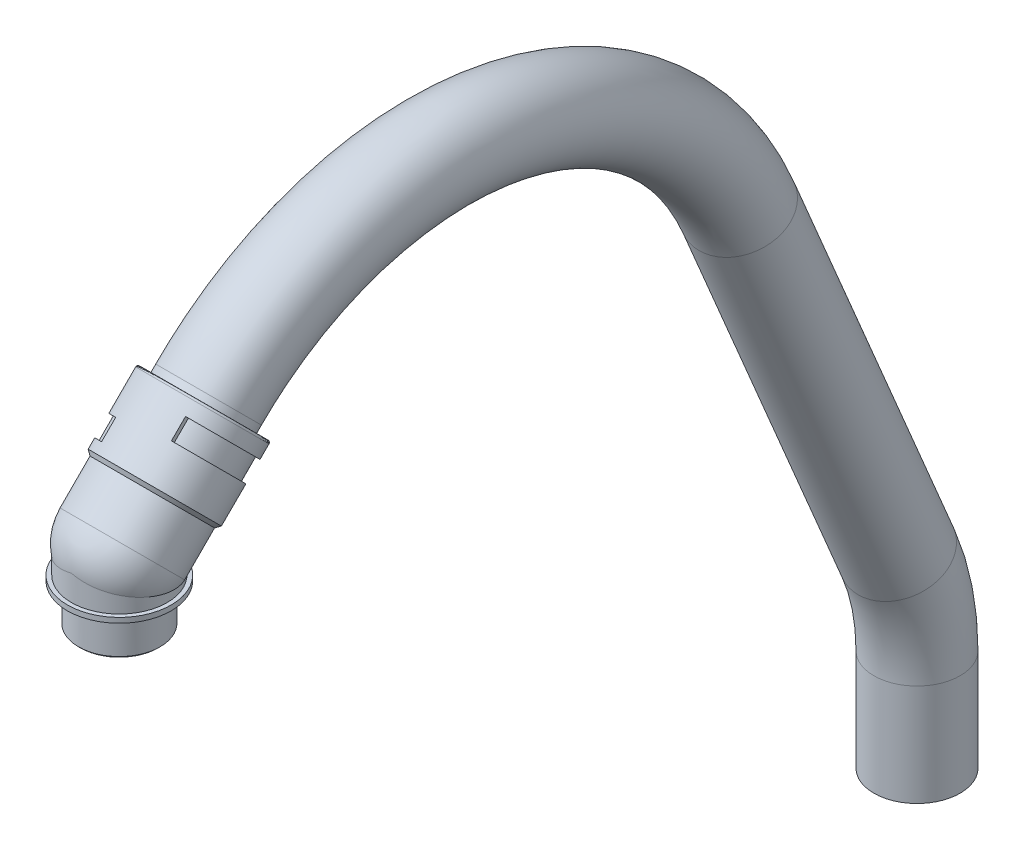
ISO-10303-21;
HEADER;
FILE_DESCRIPTION(('STEP AP214'),'2;1');
FILE_NAME('part.step','',(''),(''),'','','');
FILE_SCHEMA(('AUTOMOTIVE_DESIGN { 1 0 10303 214 1 1 1 1 }'));
ENDSEC;
DATA;
#1=APPLICATION_CONTEXT('core data for automotive mechanical design processes');
#2=APPLICATION_PROTOCOL_DEFINITION('international standard','automotive_design',2000,#1);
#3=PRODUCT_CONTEXT('',#1,'mechanical');
#4=PRODUCT('Part','Part','',(#3));
#5=PRODUCT_RELATED_PRODUCT_CATEGORY('part','',(#4));
#6=PRODUCT_DEFINITION_FORMATION('','',#4);
#7=PRODUCT_DEFINITION_CONTEXT('part definition',#1,'design');
#8=PRODUCT_DEFINITION('design','',#6,#7);
#9=PRODUCT_DEFINITION_SHAPE('','',#8);
#10=(LENGTH_UNIT() NAMED_UNIT(*) SI_UNIT(.MILLI.,.METRE.));
#11=(NAMED_UNIT(*) PLANE_ANGLE_UNIT() SI_UNIT($,.RADIAN.));
#12=(NAMED_UNIT(*) SI_UNIT($,.STERADIAN.) SOLID_ANGLE_UNIT());
#13=UNCERTAINTY_MEASURE_WITH_UNIT(LENGTH_MEASURE(1.E-05),#10,'distance_accuracy_value','');
#14=(GEOMETRIC_REPRESENTATION_CONTEXT(3) GLOBAL_UNCERTAINTY_ASSIGNED_CONTEXT((#13)) GLOBAL_UNIT_ASSIGNED_CONTEXT((#10,
#11,#12)) REPRESENTATION_CONTEXT('',''));
#15=CARTESIAN_POINT('',(0.,0.,0.));
#16=DIRECTION('',(0.,0.,1.));
#17=DIRECTION('',(1.,0.,0.));
#18=AXIS2_PLACEMENT_3D('',#15,#16,#17);
#19=CARTESIAN_POINT('',(5.42532992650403E-13,470.850000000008,249.077568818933));
#20=DIRECTION('',(0.,1.,0.));
#21=DIRECTION('',(0.,0.,1.));
#22=AXIS2_PLACEMENT_3D('',#19,#20,#21);
#23=CYLINDRICAL_SURFACE('',#22,25.5);
#24=CARTESIAN_POINT('',(5.42097537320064E-13,472.100000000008,249.077568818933));
#25=DIRECTION('',(0.,1.,0.));
#26=DIRECTION('',(0.,0.,1.));
#27=AXIS2_PLACEMENT_3D('',#24,#25,#26);
#28=CIRCLE('',#27,25.5);
#29=CARTESIAN_POINT('',(5.43724054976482E-13,472.100000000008,274.577568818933));
#30=VERTEX_POINT('',#29);
#31=EDGE_CURVE('P0_E173',#30,#30,#28,.T.);
#32=ORIENTED_EDGE('',*,*,#31,.F.);
#33=EDGE_LOOP('',(#32));
#34=FACE_BOUND('',#33,.T.);
#35=CARTESIAN_POINT('',(5.42968447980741E-13,469.600000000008,249.077568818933));
#36=DIRECTION('',(0.,1.,0.));
#37=DIRECTION('',(0.,0.,1.));
#38=AXIS2_PLACEMENT_3D('',#35,#36,#37);
#39=CIRCLE('',#38,25.5);
#40=CARTESIAN_POINT('',(5.44594965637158E-13,469.600000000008,274.577568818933));
#41=VERTEX_POINT('',#40);
#42=EDGE_CURVE('P0_E19',#41,#41,#39,.F.);
#43=ORIENTED_EDGE('',*,*,#42,.F.);
#44=EDGE_LOOP('',(#43));
#45=FACE_BOUND('',#44,.T.);
#46=ADVANCED_FACE('P0_F16',(#34,#45),#23,.T.);
#47=CARTESIAN_POINT('',(5.3884759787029E-13,469.600000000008,271.827568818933));
#48=DIRECTION('',(0.,-1.,0.));
#49=DIRECTION('',(0.,0.,-1.));
#50=AXIS2_PLACEMENT_3D('',#47,#48,#49);
#51=PLANE('',#50);
#52=CARTESIAN_POINT('',(5.42968447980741E-13,469.600000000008,249.077568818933));
#53=DIRECTION('',(0.,-1.,0.));
#54=DIRECTION('',(0.,0.,-1.));
#55=AXIS2_PLACEMENT_3D('',#52,#53,#54);
#56=CIRCLE('',#55,20.);
#57=CARTESIAN_POINT('',(5.4169274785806E-13,469.600000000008,229.077568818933));
#58=VERTEX_POINT('',#57);
#59=EDGE_CURVE('P0_E132',#58,#58,#56,.T.);
#60=ORIENTED_EDGE('',*,*,#59,.F.);
#61=EDGE_LOOP('',(#60));
#62=FACE_BOUND('',#61,.T.);
#63=ORIENTED_EDGE('',*,*,#42,.T.);
#64=EDGE_LOOP('',(#63));
#65=FACE_BOUND('',#64,.T.);
#66=ADVANCED_FACE('P0_F180',(#62,#65),#51,.T.);
#67=CARTESIAN_POINT('',(5.37659698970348E-13,472.100000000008,273.577568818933));
#68=DIRECTION('',(0.,1.,0.));
#69=DIRECTION('',(0.,0.,1.));
#70=AXIS2_PLACEMENT_3D('',#67,#68,#69);
#71=PLANE('',#70);
#72=CARTESIAN_POINT('',(5.42799172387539E-13,472.100000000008,260.077568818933));
#73=DIRECTION('',(0.,1.,0.));
#74=DIRECTION('',(0.,0.,-1.));
#75=AXIS2_PLACEMENT_3D('',#72,#73,#74);
#76=ELLIPSE('',#75,35.3553390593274,25.);
#77=CARTESIAN_POINT('',(10.8919369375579,472.100000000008,228.254127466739));
#78=VERTEX_POINT('',#77);
#79=CARTESIAN_POINT('',(-10.8919369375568,472.100000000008,228.254127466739));
#80=VERTEX_POINT('',#79);
#81=EDGE_CURVE('P0_E47',#78,#80,#76,.T.);
#82=ORIENTED_EDGE('',*,*,#81,.F.);
#83=CARTESIAN_POINT('',(5.42097537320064E-13,472.100000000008,249.077568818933));
#84=DIRECTION('',(0.,1.,0.));
#85=DIRECTION('',(0.,0.,1.));
#86=AXIS2_PLACEMENT_3D('',#83,#84,#85);
#87=CIRCLE('',#86,23.5);
#88=EDGE_CURVE('P0_E57',#80,#78,#87,.T.);
#89=ORIENTED_EDGE('',*,*,#88,.F.);
#90=EDGE_LOOP('',(#82,#89));
#91=FACE_BOUND('',#90,.T.);
#92=ORIENTED_EDGE('',*,*,#31,.T.);
#93=EDGE_LOOP('',(#92));
#94=FACE_BOUND('',#93,.T.);
#95=ADVANCED_FACE('P0_F190',(#91,#94),#71,.T.);
#96=CARTESIAN_POINT('',(5.37647306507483E-13,484.600000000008,247.577568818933));
#97=DIRECTION('',(0.,-0.707106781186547,-0.707106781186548));
#98=DIRECTION('',(-1.,0.,0.));
#99=AXIS2_PLACEMENT_3D('',#96,#97,#98);
#100=SPHERICAL_SURFACE('',#99,25.);
#101=CARTESIAN_POINT('',(-20.3289156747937,474.310802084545,237.288370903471));
#102=CARTESIAN_POINT('',(-20.5100539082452,474.356365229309,237.600672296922));
#103=CARTESIAN_POINT('',(-20.6839303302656,474.402819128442,237.917077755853));
#104=CARTESIAN_POINT('',(-21.029038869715,474.5009380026,238.580851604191));
#105=CARTESIAN_POINT('',(-21.1991409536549,474.552735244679,238.92878847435));
#106=CARTESIAN_POINT('',(-21.4887863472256,474.647476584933,239.560344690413));
#107=CARTESIAN_POINT('',(-21.6115508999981,474.690062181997,239.842548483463));
#108=CARTESIAN_POINT('',(-21.8984820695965,474.795952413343,240.539125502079));
#109=CARTESIAN_POINT('',(-22.0564877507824,474.859974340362,240.95594846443));
#110=CARTESIAN_POINT('',(-22.3324571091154,474.983328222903,241.751609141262));
#111=CARTESIAN_POINT('',(-22.4529091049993,475.04240906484,242.129625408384));
#112=CARTESIAN_POINT('',(-22.6228616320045,475.134565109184,242.713663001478));
#113=CARTESIAN_POINT('',(-22.6792814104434,475.166938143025,242.917801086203));
#114=CARTESIAN_POINT('',(-22.7656418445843,475.21958988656,243.247384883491));
#115=CARTESIAN_POINT('',(-22.7973151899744,475.239651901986,243.372412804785));
#116=CARTESIAN_POINT('',(-22.9081716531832,475.312608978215,243.825657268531));
#117=CARTESIAN_POINT('',(-22.9812939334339,475.36609934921,244.155270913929));
#118=CARTESIAN_POINT('',(-23.1591185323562,475.511988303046,245.047854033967));
#119=CARTESIAN_POINT('',(-23.250325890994,475.605528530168,245.613398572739));
#120=CARTESIAN_POINT('',(-23.3624751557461,475.757609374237,246.517006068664));
#121=CARTESIAN_POINT('',(-23.3969018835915,475.814851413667,246.853697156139));
#122=CARTESIAN_POINT('',(-23.4543412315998,475.937413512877,247.567184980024));
#123=CARTESIAN_POINT('',(-23.4755657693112,476.002900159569,247.944101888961));
#124=CARTESIAN_POINT('',(-23.4971808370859,476.120755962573,248.613508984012));
#125=CARTESIAN_POINT('',(-23.5011790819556,476.172769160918,248.905954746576));
#126=CARTESIAN_POINT('',(-23.4977044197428,476.294985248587,249.587840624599));
#127=CARTESIAN_POINT('',(-23.4859774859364,476.365488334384,249.977214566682));
#128=CARTESIAN_POINT('',(-23.4446540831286,476.503566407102,250.72920352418));
#129=CARTESIAN_POINT('',(-23.4162741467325,476.571032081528,251.091906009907));
#130=CARTESIAN_POINT('',(-23.3536612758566,476.687189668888,251.708153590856));
#131=CARTESIAN_POINT('',(-23.3236524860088,476.735522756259,251.962206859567));
#132=CARTESIAN_POINT('',(-23.2245022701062,476.876806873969,252.698143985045));
#133=CARTESIAN_POINT('',(-23.1445029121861,476.970610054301,253.178457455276));
#134=CARTESIAN_POINT('',(-22.9777243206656,477.137777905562,254.018171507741));
#135=CARTESIAN_POINT('',(-22.8971789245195,477.210645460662,254.378928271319));
#136=CARTESIAN_POINT('',(-22.765305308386,477.31962182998,254.910369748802));
#137=CARTESIAN_POINT('',(-22.7204365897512,477.355232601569,255.082773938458));
#138=CARTESIAN_POINT('',(-22.6195604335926,477.432253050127,255.453029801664));
#139=CARTESIAN_POINT('',(-22.5629033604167,477.473708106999,255.650695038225));
#140=CARTESIAN_POINT('',(-22.3878560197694,477.596759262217,256.232432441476));
#141=CARTESIAN_POINT('',(-22.2621871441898,477.678878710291,256.614231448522));
#142=CARTESIAN_POINT('',(-21.9957493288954,477.842048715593,257.358934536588));
#143=CARTESIAN_POINT('',(-21.8555648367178,477.923054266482,257.722058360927));
#144=CARTESIAN_POINT('',(-21.5622714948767,478.08384600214,258.429121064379));
#145=CARTESIAN_POINT('',(-21.4097214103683,478.163587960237,258.77330171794));
#146=CARTESIAN_POINT('',(-21.0937725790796,478.321646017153,259.442362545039));
#147=CARTESIAN_POINT('',(-20.9309054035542,478.399920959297,259.767503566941));
#148=CARTESIAN_POINT('',(-20.5962718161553,478.55477078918,260.398554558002));
#149=CARTESIAN_POINT('',(-20.4250092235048,478.631310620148,260.704740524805));
#150=CARTESIAN_POINT('',(-20.0492071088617,478.793757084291,261.342596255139));
#151=CARTESIAN_POINT('',(-19.8430852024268,478.879758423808,261.673311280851));
#152=CARTESIAN_POINT('',(-19.4199414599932,479.050783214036,262.316079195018));
#153=CARTESIAN_POINT('',(-19.203299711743,479.135780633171,262.628389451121));
#154=CARTESIAN_POINT('',(-18.7608198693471,479.304712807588,263.234381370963));
#155=CARTESIAN_POINT('',(-18.5353412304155,479.38862193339,263.528332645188));
#156=CARTESIAN_POINT('',(-18.0768022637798,479.555266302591,264.097764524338));
#157=CARTESIAN_POINT('',(-17.8440799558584,479.637977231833,264.373524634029));
#158=CARTESIAN_POINT('',(-17.3725427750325,479.802080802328,264.906869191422));
#159=CARTESIAN_POINT('',(-17.134044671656,479.883451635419,265.164740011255));
#160=CARTESIAN_POINT('',(-16.7703501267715,480.005187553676,265.540704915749));
#161=CARTESIAN_POINT('',(-16.6494009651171,480.045301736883,265.663015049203));
#162=CARTESIAN_POINT('',(-16.3888479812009,480.130940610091,265.920771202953));
#163=CARTESIAN_POINT('',(-16.2488762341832,480.176485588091,266.055838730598));
#164=CARTESIAN_POINT('',(-15.8285908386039,480.311955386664,266.451436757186));
#165=CARTESIAN_POINT('',(-15.5435548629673,480.402172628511,266.706883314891));
#166=CARTESIAN_POINT('',(-14.9678223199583,480.581442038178,267.198053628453));
#167=CARTESIAN_POINT('',(-14.6773821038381,480.670477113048,267.434084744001));
#168=CARTESIAN_POINT('',(-14.0922185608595,480.847337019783,267.886886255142));
#169=CARTESIAN_POINT('',(-13.797729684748,480.935145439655,268.103965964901));
#170=CARTESIAN_POINT('',(-13.205730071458,481.109469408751,268.519396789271));
#171=CARTESIAN_POINT('',(-12.908431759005,481.195970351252,268.718056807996));
#172=CARTESIAN_POINT('',(-12.3119349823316,481.367558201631,269.097254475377));
#173=CARTESIAN_POINT('',(-12.012927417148,481.452633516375,269.278097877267));
#174=CARTESIAN_POINT('',(-11.3697370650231,481.63372225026,269.647764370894));
#175=CARTESIAN_POINT('',(-11.0245426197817,481.729786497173,269.834805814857));
#176=CARTESIAN_POINT('',(-10.3318856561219,481.920665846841,270.187976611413));
#177=CARTESIAN_POINT('',(-9.9845861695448,482.015470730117,270.354431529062));
#178=CARTESIAN_POINT('',(-9.28878030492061,482.203857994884,270.667146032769));
#179=CARTESIAN_POINT('',(-8.94041253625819,482.297430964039,270.813719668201));
#180=CARTESIAN_POINT('',(-8.24336590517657,482.483365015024,271.087417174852));
#181=CARTESIAN_POINT('',(-7.89480217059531,482.575718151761,271.214839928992));
#182=CARTESIAN_POINT('',(-7.19805770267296,482.759220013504,271.451000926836));
#183=CARTESIAN_POINT('',(-6.8499704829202,482.850362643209,271.560019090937));
#184=CARTESIAN_POINT('',(-6.3265046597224,482.986685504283,271.710679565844));
#185=CARTESIAN_POINT('',(-6.15286206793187,483.031785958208,271.75850059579));
#186=CARTESIAN_POINT('',(-5.79636329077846,483.124164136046,271.852285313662));
#187=CARTESIAN_POINT('',(-5.61345717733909,483.17144469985,271.898056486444));
#188=CARTESIAN_POINT('',(-5.06706663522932,483.31239929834,272.027821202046));
#189=CARTESIAN_POINT('',(-4.70206068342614,483.406187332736,272.10537707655));
#190=CARTESIAN_POINT('',(-3.97344354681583,483.59276441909,272.242148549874));
#191=CARTESIAN_POINT('',(-3.60987256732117,483.685551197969,272.301582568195));
#192=CARTESIAN_POINT('',(-2.88420673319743,483.870253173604,272.402758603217));
#193=CARTESIAN_POINT('',(-2.52213670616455,483.962167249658,272.444680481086));
#194=CARTESIAN_POINT('',(-1.79942133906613,484.145289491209,272.511365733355));
#195=CARTESIAN_POINT('',(-1.43878858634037,484.236497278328,272.536266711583));
#196=CARTESIAN_POINT('',(-0.718765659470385,484.418460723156,272.569325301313));
#197=CARTESIAN_POINT('',(-0.359379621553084,484.509216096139,272.577574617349));
#198=CARTESIAN_POINT('',(5.3733740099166E-13,484.600000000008,272.577568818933));
#199=B_SPLINE_CURVE_WITH_KNOTS('',3,(#101,#102,#103,#104,#105,#106,#107,#108,#109,#110,#111,
#112,#113,#114,#115,#116,#117,#118,#119,#120,#121,#122,#123,#124,#125,#126,#127,#128,#129,#130,
#131,#132,#133,#134,#135,#136,#137,#138,#139,#140,#141,#142,#143,#144,#145,#146,#147,#148,#149,
#150,#151,#152,#153,#154,#155,#156,#157,#158,#159,#160,#161,#162,#163,#164,#165,#166,#167,#168,
#169,#170,#171,#172,#173,#174,#175,#176,#177,#178,#179,#180,#181,#182,#183,#184,#185,#186,#187,
#188,#189,#190,#191,#192,#193,#194,#195,#196,#197,#198),.UNSPECIFIED.,.F.,.F.,(4,2,2,2,2,2,2,2,
2,2,2,2,2,2,2,2,2,2,2,2,2,2,2,2,2,2,2,2,2,2,2,2,2,2,2,2,2,2,2,2,2,2,2,2,2,2,2,2,4),(0.,
1.09162907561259,2.26335162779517,3.19519156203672,4.54544124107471,5.74826980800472,
6.39095150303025,6.78252204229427,7.80774797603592,9.54730545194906,10.5768147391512,
11.7257895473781,12.6167989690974,13.803932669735,14.9135681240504,15.694500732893,
17.1811022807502,18.3109620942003,18.8559352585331,19.4851604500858,20.7153488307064,
21.9076392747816,23.0616873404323,24.1772424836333,25.2541481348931,26.4508666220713,
27.6188774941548,28.7580306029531,29.8682507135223,30.949541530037,31.4793925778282,
32.0786633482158,33.2578985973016,34.4115905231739,35.5399249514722,36.6431960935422,
37.7218146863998,38.9339031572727,40.1233329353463,41.2909776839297,42.437910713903,
43.5654170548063,44.1223818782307,44.7054875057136,45.859321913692,46.9986430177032,
48.1259563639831,49.2440447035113,50.3559584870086),.UNSPECIFIED.);
#200=CARTESIAN_POINT('',(5.39926407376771E-13,484.600000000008,272.577568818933));
#201=VERTEX_POINT('',#200);
#202=CARTESIAN_POINT('',(-20.328915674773,474.310802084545,237.288370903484));
#203=VERTEX_POINT('',#202);
#204=EDGE_CURVE('P0_E130',#201,#203,#199,.F.);
#205=ORIENTED_EDGE('',*,*,#204,.F.);
#206=CARTESIAN_POINT('',(5.3733740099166E-13,484.600000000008,272.577568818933));
#207=CARTESIAN_POINT('',(0.35938881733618,484.509213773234,272.577574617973));
#208=CARTESIAN_POINT('',(0.718783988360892,484.418455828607,272.569324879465));
#209=CARTESIAN_POINT('',(1.43882720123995,484.236486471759,272.536264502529));
#210=CARTESIAN_POINT('',(1.79947110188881,484.145275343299,272.511362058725));
#211=CARTESIAN_POINT('',(2.52221093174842,483.962145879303,272.444672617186));
#212=CARTESIAN_POINT('',(2.88429426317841,483.870227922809,272.402747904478));
#213=CARTESIAN_POINT('',(3.60998897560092,483.685517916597,272.301564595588));
#214=CARTESIAN_POINT('',(3.97357551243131,483.592726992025,272.24212601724));
#215=CARTESIAN_POINT('',(4.70222605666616,483.406141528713,272.105343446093));
#216=CARTESIAN_POINT('',(5.06724983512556,483.312349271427,272.027780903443));
#217=CARTESIAN_POINT('',(5.61366788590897,483.171388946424,271.89800466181));
#218=CARTESIAN_POINT('',(5.79658377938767,483.124106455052,271.852229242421));
#219=CARTESIAN_POINT('',(6.15309323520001,483.031726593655,271.758437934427));
#220=CARTESIAN_POINT('',(6.32673678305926,482.986626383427,271.710614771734));
#221=CARTESIAN_POINT('',(6.8502084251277,482.850302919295,271.559946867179));
#222=CARTESIAN_POINT('',(7.19830023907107,482.759158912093,271.450923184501));
#223=CARTESIAN_POINT('',(7.89505773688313,482.575652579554,271.214749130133));
#224=CARTESIAN_POINT('',(8.2436298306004,482.483296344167,271.087318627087));
#225=CARTESIAN_POINT('',(8.9406970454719,482.297354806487,270.813602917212));
#226=CARTESIAN_POINT('',(9.28907694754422,482.20377745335,270.667018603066));
#227=CARTESIAN_POINT('',(9.98491083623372,482.015380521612,270.354279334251));
#228=CARTESIAN_POINT('',(10.3322261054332,481.920570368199,270.187810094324));
#229=CARTESIAN_POINT('',(11.0249183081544,481.729680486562,269.834606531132));
#230=CARTESIAN_POINT('',(11.3701320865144,481.633611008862,269.647546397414));
#231=CARTESIAN_POINT('',(12.0133391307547,481.452517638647,269.277853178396));
#232=CARTESIAN_POINT('',(12.3123446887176,481.367442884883,269.097002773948));
#233=CARTESIAN_POINT('',(12.9088405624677,481.19585410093,268.717788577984));
#234=CARTESIAN_POINT('',(13.2061398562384,481.109351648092,268.519118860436));
#235=CARTESIAN_POINT('',(13.7981444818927,480.935023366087,268.10366554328));
#236=CARTESIAN_POINT('',(14.0926372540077,480.847212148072,267.88657285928));
#237=CARTESIAN_POINT('',(14.6778113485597,480.670345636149,267.433741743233));
#238=CARTESIAN_POINT('',(14.9682580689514,480.581306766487,267.19769381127));
#239=CARTESIAN_POINT('',(15.5440060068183,480.402029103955,266.706485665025));
#240=CARTESIAN_POINT('',(15.829050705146,480.311807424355,266.451017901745));
#241=CARTESIAN_POINT('',(16.2493493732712,480.176331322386,266.055385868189));
#242=CARTESIAN_POINT('',(16.389326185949,480.130784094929,265.920305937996));
#243=CARTESIAN_POINT('',(16.6498820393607,480.045143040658,265.662532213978));
#244=CARTESIAN_POINT('',(16.7708291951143,480.00502891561,265.540217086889));
#245=CARTESIAN_POINT('',(17.1345198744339,479.883292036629,265.164234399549));
#246=CARTESIAN_POINT('',(17.3730156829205,479.801919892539,264.906350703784));
#247=CARTESIAN_POINT('',(17.8445504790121,479.637812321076,264.372976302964));
#248=CARTESIAN_POINT('',(18.0772725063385,479.555098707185,264.097199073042));
#249=CARTESIAN_POINT('',(18.5358126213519,479.388447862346,263.527728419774));
#250=CARTESIAN_POINT('',(18.761292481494,479.304534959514,263.233755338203));
#251=CARTESIAN_POINT('',(19.2037758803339,479.135594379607,262.627714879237));
#252=CARTESIAN_POINT('',(19.4204197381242,479.050592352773,262.315377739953));
#253=CARTESIAN_POINT('',(19.8435682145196,478.879557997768,261.672550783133));
#254=CARTESIAN_POINT('',(20.0496925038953,478.79355173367,261.34180345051));
#255=CARTESIAN_POINT('',(20.4254840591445,478.631101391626,260.70390657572));
#256=CARTESIAN_POINT('',(20.5967349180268,478.554562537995,260.39771241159));
#257=CARTESIAN_POINT('',(20.9313467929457,478.399712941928,259.76664005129));
#258=CARTESIAN_POINT('',(21.0942037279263,478.321437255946,259.441485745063));
#259=CARTESIAN_POINT('',(21.4101332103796,478.163376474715,258.772393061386));
#260=CARTESIAN_POINT('',(21.5626739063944,478.08363255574,258.428193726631));
#261=CARTESIAN_POINT('',(21.8559488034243,477.922835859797,257.721088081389));
#262=CARTESIAN_POINT('',(21.9961239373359,477.841827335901,257.357939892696));
#263=CARTESIAN_POINT('',(22.2625424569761,477.678650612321,256.613182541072));
#264=CARTESIAN_POINT('',(22.3882010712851,477.596527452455,256.231353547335));
#265=CARTESIAN_POINT('',(22.563231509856,477.473470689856,255.649568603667));
#266=CARTESIAN_POINT('',(22.6198828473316,477.432013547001,255.451885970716));
#267=CARTESIAN_POINT('',(22.7207422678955,477.354993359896,255.081617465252));
#268=CARTESIAN_POINT('',(22.7656005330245,477.319384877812,254.909218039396));
#269=CARTESIAN_POINT('',(22.8974468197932,477.210410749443,254.377770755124));
#270=CARTESIAN_POINT('',(22.9779752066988,477.137541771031,254.016999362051));
#271=CARTESIAN_POINT('',(23.1253543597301,476.989786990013,253.274772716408));
#272=CARTESIAN_POINT('',(23.1913864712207,476.914966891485,252.893140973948));
#273=CARTESIAN_POINT('',(23.2624851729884,476.821856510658,252.411567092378));
#274=CARTESIAN_POINT('',(23.276395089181,476.802870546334,252.313017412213));
#275=CARTESIAN_POINT('',(23.3238069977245,476.735280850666,251.960942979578));
#276=CARTESIAN_POINT('',(23.3538036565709,476.686948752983,251.706883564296));
#277=CARTESIAN_POINT('',(23.4163858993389,476.57079252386,251.090620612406));
#278=CARTESIAN_POINT('',(23.4447451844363,476.503328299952,250.727916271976));
#279=CARTESIAN_POINT('',(23.486027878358,476.365248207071,249.975898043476));
#280=CARTESIAN_POINT('',(23.4977338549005,476.294741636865,249.586496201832));
#281=CARTESIAN_POINT('',(23.5011687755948,476.172539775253,248.904661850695));
#282=CARTESIAN_POINT('',(23.4971561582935,476.120543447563,248.612295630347));
#283=CARTESIAN_POINT('',(23.4755107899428,476.002701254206,247.942980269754));
#284=CARTESIAN_POINT('',(23.4542671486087,475.937209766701,247.566078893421));
#285=CARTESIAN_POINT('',(23.3967929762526,475.81465980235,246.852518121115));
#286=CARTESIAN_POINT('',(23.3623477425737,475.757431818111,246.515744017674));
#287=CARTESIAN_POINT('',(23.3048687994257,475.679492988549,246.052954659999));
#288=CARTESIAN_POINT('',(23.288077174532,475.658224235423,245.926230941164));
#289=CARTESIAN_POINT('',(23.2083485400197,475.563563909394,245.359937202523));
#290=CARTESIAN_POINT('',(23.1339861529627,475.491345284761,244.921698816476));
#291=CARTESIAN_POINT('',(22.9812030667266,475.36604227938,244.154820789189));
#292=CARTESIAN_POINT('',(22.9080638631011,475.312534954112,243.825181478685));
#293=CARTESIAN_POINT('',(22.7971686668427,475.239557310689,243.371825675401));
#294=CARTESIAN_POINT('',(22.7654694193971,475.219481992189,243.246709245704));
#295=CARTESIAN_POINT('',(22.6790811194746,475.16682180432,242.917063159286));
#296=CARTESIAN_POINT('',(22.6226613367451,475.134452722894,242.712950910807));
#297=CARTESIAN_POINT('',(22.4527126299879,475.042308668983,242.128996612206));
#298=CARTESIAN_POINT('',(22.3322653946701,474.98323473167,241.751035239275));
#299=CARTESIAN_POINT('',(22.0840508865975,474.872299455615,241.035439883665));
#300=CARTESIAN_POINT('',(21.9579385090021,474.820269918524,240.69725760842));
#301=CARTESIAN_POINT('',(21.7926809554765,474.757113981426,240.283464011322));
#302=CARTESIAN_POINT('',(21.7608579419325,474.745163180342,240.205013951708));
#303=CARTESIAN_POINT('',(21.6114541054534,474.690025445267,239.842329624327));
#304=CARTESIAN_POINT('',(21.4886848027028,474.647442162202,239.560117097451));
#305=CARTESIAN_POINT('',(21.1990435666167,474.552707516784,238.928580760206));
#306=CARTESIAN_POINT('',(21.0289529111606,474.500914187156,238.580677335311));
#307=CARTESIAN_POINT('',(20.6838804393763,474.402805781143,237.916988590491));
#308=CARTESIAN_POINT('',(20.5100295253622,474.356358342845,237.600634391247));
#309=CARTESIAN_POINT('',(20.3289156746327,474.310802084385,237.288370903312));
#310=B_SPLINE_CURVE_WITH_KNOTS('',3,(#206,#207,#208,#209,#210,#211,#212,#213,#214,#215,#216,
#217,#218,#219,#220,#221,#222,#223,#224,#225,#226,#227,#228,#229,#230,#231,#232,#233,#234,#235,
#236,#237,#238,#239,#240,#241,#242,#243,#244,#245,#246,#247,#248,#249,#250,#251,#252,#253,#254,
#255,#256,#257,#258,#259,#260,#261,#262,#263,#264,#265,#266,#267,#268,#269,#270,#271,#272,#273,
#274,#275,#276,#277,#278,#279,#280,#281,#282,#283,#284,#285,#286,#287,#288,#289,#290,#291,#292,
#293,#294,#295,#296,#297,#298,#299,#300,#301,#302,#303,#304,#305,#306,#307,#308,#309),
.UNSPECIFIED.,.F.,.F.,(4,2,2,2,2,2,2,2,2,2,2,2,2,2,2,2,2,2,2,2,2,2,2,2,2,2,2,2,2,2,2,2,2,2,2,2,
2,2,2,2,2,2,2,2,2,2,2,2,2,2,2,4),(0.,1.1119422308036,2.23006563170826,3.35742117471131,
4.49679207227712,5.65068426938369,6.23382190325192,6.79079087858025,7.91831575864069,
9.06528159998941,10.2329740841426,11.4224670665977,12.634634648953,13.7132583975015,
14.8165486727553,15.9449166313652,17.0986568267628,18.2779553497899,18.877263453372,
19.4071207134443,20.4884354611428,21.598695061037,22.7379034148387,23.9059854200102,
25.1027909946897,26.1797002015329,27.2952771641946,28.4493653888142,29.6417143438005,
30.8719795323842,31.5012499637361,32.0462021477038,33.1760716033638,34.3589342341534,
34.6628950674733,35.4438009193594,36.5534543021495,37.7406667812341,38.6314287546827,
39.7803943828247,40.810051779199,41.1988123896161,42.5489688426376,43.5742658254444,
43.9661165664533,44.6087235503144,45.8113748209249,46.9049410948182,47.1614346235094,
48.0932529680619,49.2648844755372,50.3563527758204),.UNSPECIFIED.);
#311=CARTESIAN_POINT('',(20.3289156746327,474.310802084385,237.288370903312));
#312=VERTEX_POINT('',#311);
#313=EDGE_CURVE('P0_E61',#312,#201,#310,.F.);
#314=ORIENTED_EDGE('',*,*,#313,.F.);
#315=CARTESIAN_POINT('',(5.37647306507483E-13,484.600000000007,247.577568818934));
#316=DIRECTION('',(0.,0.707106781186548,-0.707106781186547));
#317=DIRECTION('',(-1.,0.,0.));
#318=AXIS2_PLACEMENT_3D('',#315,#316,#317);
#319=CIRCLE('',#318,25.);
#320=CARTESIAN_POINT('',(5.29554991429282E-13,502.277669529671,265.255238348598));
#321=VERTEX_POINT('',#320);
#322=EDGE_CURVE('P0_E123',#321,#312,#319,.T.);
#323=ORIENTED_EDGE('',*,*,#322,.F.);
#324=CARTESIAN_POINT('',(5.37647306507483E-13,484.600000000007,247.577568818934));
#325=DIRECTION('',(0.,0.707106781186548,-0.707106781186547));
#326=DIRECTION('',(-1.,0.,0.));
#327=AXIS2_PLACEMENT_3D('',#324,#325,#326);
#328=CIRCLE('',#327,25.);
#329=EDGE_CURVE('P0_E34',#203,#321,#328,.T.);
#330=ORIENTED_EDGE('',*,*,#329,.F.);
#331=EDGE_LOOP('',(#205,#314,#323,#330));
#332=FACE_BOUND('',#331,.T.);
#333=ADVANCED_FACE('P0_F129',(#332),#100,.T.);
#334=CARTESIAN_POINT('',(5.39920260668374E-13,478.350000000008,249.077568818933));
#335=DIRECTION('',(0.,1.,0.));
#336=DIRECTION('',(0.,0.,1.));
#337=AXIS2_PLACEMENT_3D('',#334,#335,#336);
#338=CYLINDRICAL_SURFACE('',#337,23.5);
#339=CARTESIAN_POINT('',(20.3289156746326,474.310802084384,237.288370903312));
#340=CARTESIAN_POINT('',(20.1595049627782,474.268157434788,236.996245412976));
#341=CARTESIAN_POINT('',(19.984042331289,474.221947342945,236.708191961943));
#342=CARTESIAN_POINT('',(19.62137069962,474.123973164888,236.140597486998));
#343=CARTESIAN_POINT('',(19.4341632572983,474.072209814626,235.861055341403));
#344=CARTESIAN_POINT('',(19.0483349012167,473.964699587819,235.310803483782));
#345=CARTESIAN_POINT('',(18.8497151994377,473.908953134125,235.040092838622));
#346=CARTESIAN_POINT('',(18.4413752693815,473.794693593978,234.507797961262));
#347=CARTESIAN_POINT('',(18.2316547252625,473.73618042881,234.246213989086));
#348=CARTESIAN_POINT('',(17.596097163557,473.560799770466,233.487313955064));
#349=CARTESIAN_POINT('',(17.1549781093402,473.441522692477,233.003214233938));
#350=CARTESIAN_POINT('',(16.2340655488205,473.202691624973,232.073656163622));
#351=CARTESIAN_POINT('',(15.7542806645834,473.083137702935,231.628189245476));
#352=CARTESIAN_POINT('',(14.9252847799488,472.887590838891,230.920598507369));
#353=CARTESIAN_POINT('',(14.5860871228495,472.81040501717,230.646994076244));
#354=CARTESIAN_POINT('',(13.8926409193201,472.659014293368,230.11881287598));
#355=CARTESIAN_POINT('',(13.5383956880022,472.584808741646,229.864231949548));
#356=CARTESIAN_POINT('',(12.8101679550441,472.439211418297,229.371074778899));
#357=CARTESIAN_POINT('',(12.4359656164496,472.367880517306,229.132805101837));
#358=CARTESIAN_POINT('',(11.6739039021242,472.230079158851,228.677392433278));
#359=CARTESIAN_POINT('',(11.2860405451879,472.163610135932,228.46025567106));
#360=CARTESIAN_POINT('',(10.8919369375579,472.100000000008,228.254127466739));
#361=B_SPLINE_CURVE_WITH_KNOTS('',3,(#339,#340,#341,#342,#343,#344,#345,#346,#347,#348,#349,
#350,#351,#352,#353,#354,#355,#356,#357,#358,#359,#360),.UNSPECIFIED.,.F.,.F.,(4,2,2,2,2,2,2,2,
2,2,4),(0.,1.02097858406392,2.04182202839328,3.06255725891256,4.0833215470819,6.07802283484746,
8.07228054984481,9.39938515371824,10.7261988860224,12.0734298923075,13.4210568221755),.UNSPECIFIED.);
#362=EDGE_CURVE('P0_E125',#312,#78,#361,.T.);
#363=ORIENTED_EDGE('',*,*,#362,.F.);
#364=ORIENTED_EDGE('',*,*,#313,.T.);
#365=ORIENTED_EDGE('',*,*,#204,.T.);
#366=CARTESIAN_POINT('',(-10.8919369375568,472.100000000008,228.254127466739));
#367=CARTESIAN_POINT('',(-11.1904568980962,472.148192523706,228.410267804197));
#368=CARTESIAN_POINT('',(-11.4854023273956,472.198014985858,228.572721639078));
#369=CARTESIAN_POINT('',(-12.0676615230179,472.300572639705,228.909904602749));
#370=CARTESIAN_POINT('',(-12.3549755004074,472.353307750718,229.084633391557));
#371=CARTESIAN_POINT('',(-12.9214954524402,472.461344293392,229.446016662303));
#372=CARTESIAN_POINT('',(-13.2007017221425,472.516645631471,229.632670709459));
#373=CARTESIAN_POINT('',(-13.750554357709,472.62941146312,230.0175348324));
#374=CARTESIAN_POINT('',(-14.0212007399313,472.686875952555,230.215744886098));
#375=CARTESIAN_POINT('',(-14.8075904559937,472.859222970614,230.817929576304));
#376=CARTESIAN_POINT('',(-15.3107789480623,472.976571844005,231.237772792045));
#377=CARTESIAN_POINT('',(-16.2798866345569,473.213979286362,232.117510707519));
#378=CARTESIAN_POINT('',(-16.7458137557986,473.334037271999,232.577396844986));
#379=CARTESIAN_POINT('',(-17.4886110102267,473.531962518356,233.374448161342));
#380=CARTESIAN_POINT('',(-17.776570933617,473.610503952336,233.701180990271));
#381=CARTESIAN_POINT('',(-18.3341576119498,473.7645784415,234.370484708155));
#382=CARTESIAN_POINT('',(-18.6037891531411,473.840112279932,234.713051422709));
#383=CARTESIAN_POINT('',(-19.1281150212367,473.986959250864,235.418819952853));
#384=CARTESIAN_POINT('',(-19.3825151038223,474.058189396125,235.782258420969));
#385=CARTESIAN_POINT('',(-19.748915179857,474.158531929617,236.338663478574));
#386=CARTESIAN_POINT('',(-19.8685450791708,474.190903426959,236.526057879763));
#387=CARTESIAN_POINT('',(-20.1026328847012,474.252978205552,236.904498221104));
#388=CARTESIAN_POINT('',(-20.2170904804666,474.282681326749,237.095544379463));
#389=CARTESIAN_POINT('',(-20.3289156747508,474.310802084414,237.288370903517));
#390=B_SPLINE_CURVE_WITH_KNOTS('',3,(#366,#367,#368,#369,#370,#371,#372,#373,#374,#375,#376,
#377,#378,#379,#380,#381,#382,#383,#384,#385,#386,#387,#388,#389),.UNSPECIFIED.,.F.,.F.,(4,2,2,
2,2,2,2,2,2,2,2,4),(0.,1.0208606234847,2.04169298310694,3.06248814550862,4.08328135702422,
6.07812846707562,8.07255006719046,9.39956020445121,10.7262224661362,12.073330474,
12.7472441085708,13.4211981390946),.UNSPECIFIED.);
#391=EDGE_CURVE('P0_E169',#80,#203,#390,.T.);
#392=ORIENTED_EDGE('',*,*,#391,.F.);
#393=ORIENTED_EDGE('',*,*,#88,.T.);
#394=EDGE_LOOP('',(#363,#364,#365,#392,#393));
#395=FACE_BOUND('',#394,.T.);
#396=ADVANCED_FACE('P0_F135',(#395),#338,.T.);
#397=CARTESIAN_POINT('',(5.45668271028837E-13,461.850000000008,249.077568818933));
#398=DIRECTION('',(0.,-1.,0.));
#399=DIRECTION('',(0.,0.,-1.));
#400=AXIS2_PLACEMENT_3D('',#397,#398,#399);
#401=CYLINDRICAL_SURFACE('',#400,20.);
#402=ORIENTED_EDGE('',*,*,#59,.T.);
#403=EDGE_LOOP('',(#402));
#404=FACE_BOUND('',#403,.T.);
#405=CARTESIAN_POINT('',(5.49266873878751E-13,451.520000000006,249.077568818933));
#406=DIRECTION('',(0.,1.,0.));
#407=DIRECTION('',(0.,0.,1.));
#408=AXIS2_PLACEMENT_3D('',#405,#406,#407);
#409=CIRCLE('',#408,20.0000000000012);
#410=CARTESIAN_POINT('',(5.45644148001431E-13,451.520000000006,269.077568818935));
#411=VERTEX_POINT('',#410);
#412=EDGE_CURVE('P0_E136',#411,#411,#409,.F.);
#413=ORIENTED_EDGE('',*,*,#412,.F.);
#414=EDGE_LOOP('',(#413));
#415=FACE_BOUND('',#414,.T.);
#416=ADVANCED_FACE('P0_F158',(#404,#415),#401,.T.);
#417=CARTESIAN_POINT('',(5.34613879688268E-13,491.960019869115,240.217548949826));
#418=DIRECTION('',(0.,0.707106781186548,-0.707106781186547));
#419=DIRECTION('',(-1.,0.,0.));
#420=AXIS2_PLACEMENT_3D('',#417,#418,#419);
#421=CYLINDRICAL_SURFACE('',#420,25.);
#422=CARTESIAN_POINT('',(5.31580452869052E-13,499.320039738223,232.857529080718));
#423=DIRECTION('',(0.,0.707106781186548,-0.707106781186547));
#424=DIRECTION('',(0.,0.707106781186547,0.707106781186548));
#425=AXIS2_PLACEMENT_3D('',#422,#423,#424);
#426=CIRCLE('',#425,24.9999999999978);
#427=CARTESIAN_POINT('',(5.2654975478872E-13,516.997709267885,250.53519861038));
#428=VERTEX_POINT('',#427);
#429=EDGE_CURVE('P0_E139',#428,#428,#426,.T.);
#430=ORIENTED_EDGE('',*,*,#429,.F.);
#431=EDGE_LOOP('',(#430));
#432=FACE_BOUND('',#431,.T.);
#433=ORIENTED_EDGE('',*,*,#322,.T.);
#434=ORIENTED_EDGE('',*,*,#362,.T.);
#435=ORIENTED_EDGE('',*,*,#81,.T.);
#436=ORIENTED_EDGE('',*,*,#391,.T.);
#437=ORIENTED_EDGE('',*,*,#329,.T.);
#438=EDGE_LOOP('',(#433,#434,#435,#436,#437));
#439=FACE_BOUND('',#438,.T.);
#440=ADVANCED_FACE('P0_F124',(#432,#439),#421,.T.);
#441=CARTESIAN_POINT('',(5.25046448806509E-13,519.483513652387,212.694055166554));
#442=DIRECTION('',(0.,0.707106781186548,-0.707106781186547));
#443=DIRECTION('',(-1.,0.,0.));
#444=AXIS2_PLACEMENT_3D('',#441,#442,#443);
#445=CYLINDRICAL_SURFACE('',#444,25.);
#446=CARTESIAN_POINT('',(5.25046448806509E-13,519.483513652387,212.694055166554));
#447=DIRECTION('',(0.,0.707106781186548,-0.707106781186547));
#448=DIRECTION('',(-1.,0.,0.));
#449=AXIS2_PLACEMENT_3D('',#446,#447,#448);
#450=CIRCLE('',#449,25.);
#451=CARTESIAN_POINT('',(12.7793779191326,504.289970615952,197.500512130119));
#452=VERTEX_POINT('',#451);
#453=CARTESIAN_POINT('',(12.7793779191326,534.677056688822,227.887598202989));
#454=VERTEX_POINT('',#453);
#455=EDGE_CURVE('P0_E115',#452,#454,#450,.F.);
#456=ORIENTED_EDGE('',*,*,#455,.T.);
#457=DIRECTION('',(0.,-0.707106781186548,0.707106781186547));
#458=VECTOR('',#457,1.);
#459=CARTESIAN_POINT('',(12.7793779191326,534.677056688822,227.887598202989));
#460=LINE('',#459,#458);
#461=CARTESIAN_POINT('',(12.7793779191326,527.747410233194,234.817244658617));
#462=VERTEX_POINT('',#461);
#463=EDGE_CURVE('P0_E122',#454,#462,#460,.T.);
#464=ORIENTED_EDGE('',*,*,#463,.T.);
#465=CARTESIAN_POINT('',(5.27902497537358E-13,512.553867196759,219.623701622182));
#466=DIRECTION('',(0.,0.707106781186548,-0.707106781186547));
#467=DIRECTION('',(-1.,0.,0.));
#468=AXIS2_PLACEMENT_3D('',#465,#466,#467);
#469=CIRCLE('',#468,25.);
#470=CARTESIAN_POINT('',(12.7793779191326,497.360324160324,204.430158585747));
#471=VERTEX_POINT('',#470);
#472=EDGE_CURVE('P0_E298',#471,#462,#469,.F.);
#473=ORIENTED_EDGE('',*,*,#472,.F.);
#474=DIRECTION('',(0.,-0.707106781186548,0.707106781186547));
#475=VECTOR('',#474,1.);
#476=CARTESIAN_POINT('',(12.7793779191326,504.289970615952,197.500512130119));
#477=LINE('',#476,#475);
#478=EDGE_CURVE('P0_E308',#471,#452,#477,.F.);
#479=ORIENTED_EDGE('',*,*,#478,.T.);
#480=EDGE_LOOP('',(#456,#464,#473,#479));
#481=FACE_BOUND('',#480,.T.);
#482=ADVANCED_FACE('P0_F157',(#481),#445,.T.);
#483=CARTESIAN_POINT('',(5.23331153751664E-13,510.715389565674,221.462179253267));
#484=DIRECTION('',(0.,0.707106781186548,-0.707106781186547));
#485=DIRECTION('',(-1.,0.,0.));
#486=AXIS2_PLACEMENT_3D('',#483,#484,#485);
#487=CYLINDRICAL_SURFACE('',#486,25.);
#488=CARTESIAN_POINT('',(5.23331153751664E-13,510.715389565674,221.462179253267));
#489=DIRECTION('',(0.,0.707106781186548,-0.707106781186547));
#490=DIRECTION('',(-1.,0.,0.));
#491=AXIS2_PLACEMENT_3D('',#488,#489,#490);
#492=CIRCLE('',#491,25.);
#493=CARTESIAN_POINT('',(-12.7793779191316,525.908932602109,236.655722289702));
#494=VERTEX_POINT('',#493);
#495=CARTESIAN_POINT('',(-12.7793779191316,495.521846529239,206.268636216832));
#496=VERTEX_POINT('',#495);
#497=EDGE_CURVE('P0_E294',#494,#496,#492,.F.);
#498=ORIENTED_EDGE('',*,*,#497,.T.);
#499=DIRECTION('',(0.,0.707106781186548,-0.707106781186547));
#500=VECTOR('',#499,1.);
#501=CARTESIAN_POINT('',(-12.7793779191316,495.521846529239,206.268636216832));
#502=LINE('',#501,#500);
#503=CARTESIAN_POINT('',(-12.7793779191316,488.592200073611,213.19828267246));
#504=VERTEX_POINT('',#503);
#505=EDGE_CURVE('P0_E297',#496,#504,#502,.F.);
#506=ORIENTED_EDGE('',*,*,#505,.T.);
#507=CARTESIAN_POINT('',(5.26187202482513E-13,503.785743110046,228.391825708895));
#508=DIRECTION('',(0.,0.707106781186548,-0.707106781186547));
#509=DIRECTION('',(-1.,0.,0.));
#510=AXIS2_PLACEMENT_3D('',#507,#508,#509);
#511=CIRCLE('',#510,25.);
#512=CARTESIAN_POINT('',(-12.7793779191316,518.979286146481,243.58536874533));
#513=VERTEX_POINT('',#512);
#514=EDGE_CURVE('P0_E276',#513,#504,#511,.F.);
#515=ORIENTED_EDGE('',*,*,#514,.F.);
#516=DIRECTION('',(0.,0.707106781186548,-0.707106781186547));
#517=VECTOR('',#516,1.);
#518=CARTESIAN_POINT('',(-12.7793779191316,525.908932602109,236.655722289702));
#519=LINE('',#518,#517);
#520=EDGE_CURVE('P0_E290',#513,#494,#519,.T.);
#521=ORIENTED_EDGE('',*,*,#520,.T.);
#522=EDGE_LOOP('',(#498,#506,#515,#521));
#523=FACE_BOUND('',#522,.T.);
#524=ADVANCED_FACE('P0_F411',(#523),#487,.T.);
#525=CARTESIAN_POINT('',(5.49266873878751E-13,451.520000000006,249.077568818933));
#526=DIRECTION('',(0.,1.,0.));
#527=DIRECTION('',(0.,0.,1.));
#528=AXIS2_PLACEMENT_3D('',#525,#526,#527);
#529=CONICAL_SURFACE('',#528,20.0000000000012,0.785398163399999);
#530=ORIENTED_EDGE('',*,*,#412,.T.);
#531=EDGE_LOOP('',(#530));
#532=FACE_BOUND('',#531,.T.);
#533=CARTESIAN_POINT('',(5.49643794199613E-13,450.600000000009,249.077568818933));
#534=DIRECTION('',(0.,1.,0.));
#535=DIRECTION('',(0.,0.,1.));
#536=AXIS2_PLACEMENT_3D('',#533,#534,#535);
#537=CIRCLE('',#536,19.0799999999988);
#538=CARTESIAN_POINT('',(5.5086081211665E-13,450.600000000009,268.157568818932));
#539=VERTEX_POINT('',#538);
#540=EDGE_CURVE('P0_E271',#539,#539,#537,.F.);
#541=ORIENTED_EDGE('',*,*,#540,.F.);
#542=EDGE_LOOP('',(#541));
#543=FACE_BOUND('',#542,.T.);
#544=ADVANCED_FACE('P0_F408',(#532,#543),#529,.T.);
#545=CARTESIAN_POINT('',(5.31070444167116E-13,500.557476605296,231.620092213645));
#546=DIRECTION('',(0.,0.707106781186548,-0.707106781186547));
#547=DIRECTION('',(-1.,0.,0.));
#548=AXIS2_PLACEMENT_3D('',#545,#546,#547);
#549=CONICAL_SURFACE('',#548,26.7500000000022,0.785398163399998);
#550=CARTESIAN_POINT('',(5.31070444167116E-13,500.557476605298,231.620092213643));
#551=DIRECTION('',(0.,0.707106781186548,-0.707106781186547));
#552=DIRECTION('',(-1.,0.,0.));
#553=AXIS2_PLACEMENT_3D('',#550,#551,#552);
#554=CIRCLE('',#553,26.75);
#555=CARTESIAN_POINT('',(-26.7499999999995,500.557476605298,231.620092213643));
#556=VERTEX_POINT('',#555);
#557=EDGE_CURVE('P0_E262',#556,#556,#554,.T.);
#558=ORIENTED_EDGE('',*,*,#557,.F.);
#559=EDGE_LOOP('',(#558));
#560=FACE_BOUND('',#559,.T.);
#561=ORIENTED_EDGE('',*,*,#429,.T.);
#562=EDGE_LOOP('',(#561));
#563=FACE_BOUND('',#562,.T.);
#564=ADVANCED_FACE('P0_F402',(#560,#563),#549,.T.);
#565=CARTESIAN_POINT('',(12.7793779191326,534.677056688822,227.887598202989));
#566=DIRECTION('',(-1.,0.,0.));
#567=DIRECTION('',(0.,-0.707106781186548,0.707106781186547));
#568=AXIS2_PLACEMENT_3D('',#565,#566,#567);
#569=PLANE('',#568);
#570=ORIENTED_EDGE('',*,*,#463,.F.);
#571=DIRECTION('',(0.,0.707106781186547,0.707106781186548));
#572=VECTOR('',#571,1.);
#573=CARTESIAN_POINT('',(12.7793779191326,512.733513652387,205.944055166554));
#574=LINE('',#573,#572);
#575=CARTESIAN_POINT('',(12.7793779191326,536.100523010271,229.311064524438));
#576=VERTEX_POINT('',#575);
#577=EDGE_CURVE('P0_E309',#454,#576,#574,.T.);
#578=ORIENTED_EDGE('',*,*,#577,.T.);
#579=DIRECTION('',(0.,0.707106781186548,-0.707106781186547));
#580=VECTOR('',#579,1.);
#581=CARTESIAN_POINT('',(12.7793779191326,528.84174785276,236.569839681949));
#582=LINE('',#581,#580);
#583=CARTESIAN_POINT('',(12.7793779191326,529.170876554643,236.240710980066));
#584=VERTEX_POINT('',#583);
#585=EDGE_CURVE('P0_E270',#584,#576,#582,.T.);
#586=ORIENTED_EDGE('',*,*,#585,.F.);
#587=DIRECTION('',(0.,0.707106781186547,0.707106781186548));
#588=VECTOR('',#587,1.);
#589=CARTESIAN_POINT('',(12.7793779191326,505.803867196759,212.873701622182));
#590=LINE('',#589,#588);
#591=EDGE_CURVE('P0_E295',#462,#584,#590,.T.);
#592=ORIENTED_EDGE('',*,*,#591,.F.);
#593=EDGE_LOOP('',(#570,#578,#586,#592));
#594=FACE_BOUND('',#593,.T.);
#595=ADVANCED_FACE('P0_F385',(#594),#569,.F.);
#596=CARTESIAN_POINT('',(5.2519100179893E-13,512.733513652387,205.944055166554));
#597=DIRECTION('',(0.,0.707106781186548,-0.707106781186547));
#598=DIRECTION('',(-1.,0.,0.));
#599=AXIS2_PLACEMENT_3D('',#596,#597,#598);
#600=PLANE('',#599);
#601=ORIENTED_EDGE('',*,*,#577,.F.);
#602=ORIENTED_EDGE('',*,*,#455,.F.);
#603=DIRECTION('',(0.,0.707106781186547,0.707106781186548));
#604=VECTOR('',#603,1.);
#605=CARTESIAN_POINT('',(12.7793779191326,502.866504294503,196.07704580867));
#606=LINE('',#605,#604);
#607=CARTESIAN_POINT('',(12.7793779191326,502.866504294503,196.07704580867));
#608=VERTEX_POINT('',#607);
#609=EDGE_CURVE('P0_E302',#452,#608,#606,.F.);
#610=ORIENTED_EDGE('',*,*,#609,.T.);
#611=CARTESIAN_POINT('',(5.23270091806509E-13,519.483513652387,212.694055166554));
#612=DIRECTION('',(0.,0.707106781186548,-0.707106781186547));
#613=DIRECTION('',(-1.,0.,0.));
#614=AXIS2_PLACEMENT_3D('',#611,#612,#613);
#615=CIRCLE('',#614,26.75);
#616=EDGE_CURVE('P0_E305',#576,#608,#615,.T.);
#617=ORIENTED_EDGE('',*,*,#616,.F.);
#618=EDGE_LOOP('',(#601,#602,#610,#617));
#619=FACE_BOUND('',#618,.T.);
#620=ADVANCED_FACE('P0_F393',(#619),#600,.F.);
#621=CARTESIAN_POINT('',(12.7793779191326,502.866504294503,196.07704580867));
#622=DIRECTION('',(-1.,0.,0.));
#623=DIRECTION('',(0.,-0.707106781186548,0.707106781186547));
#624=AXIS2_PLACEMENT_3D('',#621,#622,#623);
#625=PLANE('',#624);
#626=DIRECTION('',(0.,0.707106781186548,-0.707106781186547));
#627=VECTOR('',#626,1.);
#628=CARTESIAN_POINT('',(12.7793779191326,495.607729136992,203.335820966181));
#629=LINE('',#628,#627);
#630=CARTESIAN_POINT('',(12.7793779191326,495.936857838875,203.006692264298));
#631=VERTEX_POINT('',#630);
#632=EDGE_CURVE('P0_E303',#608,#631,#629,.F.);
#633=ORIENTED_EDGE('',*,*,#632,.F.);
#634=ORIENTED_EDGE('',*,*,#609,.F.);
#635=ORIENTED_EDGE('',*,*,#478,.F.);
#636=DIRECTION('',(0.,0.707106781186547,0.707106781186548));
#637=VECTOR('',#636,1.);
#638=CARTESIAN_POINT('',(12.7793779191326,505.803867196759,212.873701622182));
#639=LINE('',#638,#637);
#640=EDGE_CURVE('P0_E299',#631,#471,#639,.T.);
#641=ORIENTED_EDGE('',*,*,#640,.F.);
#642=EDGE_LOOP('',(#633,#634,#635,#641));
#643=FACE_BOUND('',#642,.T.);
#644=ADVANCED_FACE('P0_F392',(#643),#625,.F.);
#645=CARTESIAN_POINT('',(5.28047050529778E-13,505.803867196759,212.873701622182));
#646=DIRECTION('',(0.,0.707106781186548,-0.707106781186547));
#647=DIRECTION('',(-1.,0.,0.));
#648=AXIS2_PLACEMENT_3D('',#645,#646,#647);
#649=PLANE('',#648);
#650=ORIENTED_EDGE('',*,*,#472,.T.);
#651=ORIENTED_EDGE('',*,*,#591,.T.);
#652=CARTESIAN_POINT('',(5.26126140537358E-13,512.553867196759,219.623701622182));
#653=DIRECTION('',(0.,0.707106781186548,-0.707106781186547));
#654=DIRECTION('',(-1.,0.,0.));
#655=AXIS2_PLACEMENT_3D('',#652,#653,#654);
#656=CIRCLE('',#655,26.75);
#657=EDGE_CURVE('P0_E287',#631,#584,#656,.F.);
#658=ORIENTED_EDGE('',*,*,#657,.F.);
#659=ORIENTED_EDGE('',*,*,#640,.T.);
#660=EDGE_LOOP('',(#650,#651,#658,#659));
#661=FACE_BOUND('',#660,.T.);
#662=ADVANCED_FACE('P0_F380',(#661),#649,.T.);
#663=CARTESIAN_POINT('',(-12.7793779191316,495.521846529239,206.268636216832));
#664=DIRECTION('',(1.,0.,0.));
#665=DIRECTION('',(0.,0.707106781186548,-0.707106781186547));
#666=AXIS2_PLACEMENT_3D('',#663,#664,#665);
#667=PLANE('',#666);
#668=ORIENTED_EDGE('',*,*,#505,.F.);
#669=DIRECTION('',(0.,0.707106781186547,0.707106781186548));
#670=VECTOR('',#669,1.);
#671=CARTESIAN_POINT('',(-12.7793779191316,503.965389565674,214.712179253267));
#672=LINE('',#671,#670);
#673=CARTESIAN_POINT('',(-12.7793779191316,494.09838020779,204.845169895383));
#674=VERTEX_POINT('',#673);
#675=EDGE_CURVE('P0_E291',#496,#674,#672,.F.);
#676=ORIENTED_EDGE('',*,*,#675,.T.);
#677=DIRECTION('',(0.,0.707106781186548,-0.707106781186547));
#678=VECTOR('',#677,1.);
#679=CARTESIAN_POINT('',(-12.7793779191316,495.607729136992,203.335820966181));
#680=LINE('',#679,#678);
#681=CARTESIAN_POINT('',(-12.7793779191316,487.168733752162,211.774816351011));
#682=VERTEX_POINT('',#681);
#683=EDGE_CURVE('P0_E285',#682,#674,#680,.T.);
#684=ORIENTED_EDGE('',*,*,#683,.F.);
#685=DIRECTION('',(0.,0.707106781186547,0.707106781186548));
#686=VECTOR('',#685,1.);
#687=CARTESIAN_POINT('',(-12.7793779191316,497.035743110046,221.641825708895));
#688=LINE('',#687,#686);
#689=EDGE_CURVE('P0_E274',#504,#682,#688,.F.);
#690=ORIENTED_EDGE('',*,*,#689,.F.);
#691=EDGE_LOOP('',(#668,#676,#684,#690));
#692=FACE_BOUND('',#691,.T.);
#693=ADVANCED_FACE('P0_F435',(#692),#667,.F.);
#694=CARTESIAN_POINT('',(5.28804777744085E-13,503.965389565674,214.712179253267));
#695=DIRECTION('',(0.,0.707106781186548,-0.707106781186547));
#696=DIRECTION('',(-1.,0.,0.));
#697=AXIS2_PLACEMENT_3D('',#694,#695,#696);
#698=PLANE('',#697);
#699=ORIENTED_EDGE('',*,*,#675,.F.);
#700=ORIENTED_EDGE('',*,*,#497,.F.);
#701=DIRECTION('',(0.,0.707106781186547,0.707106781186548));
#702=VECTOR('',#701,1.);
#703=CARTESIAN_POINT('',(-12.7793779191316,527.332398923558,238.079188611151));
#704=LINE('',#703,#702);
#705=CARTESIAN_POINT('',(-12.7793779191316,527.332398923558,238.079188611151));
#706=VERTEX_POINT('',#705);
#707=EDGE_CURVE('P0_E280',#494,#706,#704,.T.);
#708=ORIENTED_EDGE('',*,*,#707,.T.);
#709=CARTESIAN_POINT('',(5.26883867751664E-13,510.715389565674,221.462179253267));
#710=DIRECTION('',(0.,0.707106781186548,-0.707106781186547));
#711=DIRECTION('',(-1.,0.,0.));
#712=AXIS2_PLACEMENT_3D('',#709,#710,#711);
#713=CIRCLE('',#712,26.75);
#714=EDGE_CURVE('P0_E284',#674,#706,#713,.T.);
#715=ORIENTED_EDGE('',*,*,#714,.F.);
#716=EDGE_LOOP('',(#699,#700,#708,#715));
#717=FACE_BOUND('',#716,.T.);
#718=ADVANCED_FACE('P0_F424',(#717),#698,.F.);
#719=CARTESIAN_POINT('',(-12.7793779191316,527.332398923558,238.079188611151));
#720=DIRECTION('',(1.,0.,0.));
#721=DIRECTION('',(0.,0.707106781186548,-0.707106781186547));
#722=AXIS2_PLACEMENT_3D('',#719,#720,#721);
#723=PLANE('',#722);
#724=DIRECTION('',(0.,0.707106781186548,-0.707106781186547));
#725=VECTOR('',#724,1.);
#726=CARTESIAN_POINT('',(-12.7793779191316,528.84174785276,236.569839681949));
#727=LINE('',#726,#725);
#728=CARTESIAN_POINT('',(-12.7793779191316,520.40275246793,245.008835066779));
#729=VERTEX_POINT('',#728);
#730=EDGE_CURVE('P0_E281',#706,#729,#727,.F.);
#731=ORIENTED_EDGE('',*,*,#730,.F.);
#732=ORIENTED_EDGE('',*,*,#707,.F.);
#733=ORIENTED_EDGE('',*,*,#520,.F.);
#734=DIRECTION('',(0.,0.707106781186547,0.707106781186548));
#735=VECTOR('',#734,1.);
#736=CARTESIAN_POINT('',(-12.7793779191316,497.035743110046,221.641825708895));
#737=LINE('',#736,#735);
#738=EDGE_CURVE('P0_E277',#729,#513,#737,.F.);
#739=ORIENTED_EDGE('',*,*,#738,.F.);
#740=EDGE_LOOP('',(#731,#732,#733,#739));
#741=FACE_BOUND('',#740,.T.);
#742=ADVANCED_FACE('P0_F428',(#741),#723,.F.);
#743=CARTESIAN_POINT('',(5.31660826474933E-13,497.035743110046,221.641825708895));
#744=DIRECTION('',(0.,0.707106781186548,-0.707106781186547));
#745=DIRECTION('',(-1.,0.,0.));
#746=AXIS2_PLACEMENT_3D('',#743,#744,#745);
#747=PLANE('',#746);
#748=ORIENTED_EDGE('',*,*,#514,.T.);
#749=ORIENTED_EDGE('',*,*,#689,.T.);
#750=CARTESIAN_POINT('',(5.29739916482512E-13,503.785743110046,228.391825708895));
#751=DIRECTION('',(0.,0.707106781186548,-0.707106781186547));
#752=DIRECTION('',(-1.,0.,0.));
#753=AXIS2_PLACEMENT_3D('',#750,#751,#752);
#754=CIRCLE('',#753,26.75);
#755=EDGE_CURVE('P0_E283',#729,#682,#754,.F.);
#756=ORIENTED_EDGE('',*,*,#755,.F.);
#757=ORIENTED_EDGE('',*,*,#738,.T.);
#758=EDGE_LOOP('',(#748,#749,#756,#757));
#759=FACE_BOUND('',#758,.T.);
#760=ADVANCED_FACE('P0_F437',(#759),#747,.T.);
#761=CARTESIAN_POINT('',(5.47859328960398E-13,450.600000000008,258.617568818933));
#762=DIRECTION('',(0.,-1.,0.));
#763=DIRECTION('',(0.,0.,-1.));
#764=AXIS2_PLACEMENT_3D('',#761,#762,#763);
#765=PLANE('',#764);
#766=CARTESIAN_POINT('',(5.49587369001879E-13,450.600000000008,249.077568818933));
#767=DIRECTION('',(0.,-1.,0.));
#768=DIRECTION('',(0.,0.,-1.));
#769=AXIS2_PLACEMENT_3D('',#766,#767,#768);
#770=CIRCLE('',#769,16.7500000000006);
#771=CARTESIAN_POINT('',(5.48518970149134E-13,450.600000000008,232.327568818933));
#772=VERTEX_POINT('',#771);
#773=EDGE_CURVE('P0_E365',#772,#772,#770,.F.);
#774=ORIENTED_EDGE('',*,*,#773,.T.);
#775=EDGE_LOOP('',(#774));
#776=FACE_BOUND('',#775,.T.);
#777=ORIENTED_EDGE('',*,*,#540,.T.);
#778=EDGE_LOOP('',(#777));
#779=FACE_BOUND('',#778,.T.);
#780=ADVANCED_FACE('P0_F439',(#776,#779),#765,.T.);
#781=CARTESIAN_POINT('',(5.26261790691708E-13,512.224738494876,219.952830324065));
#782=DIRECTION('',(0.,0.707106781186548,-0.707106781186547));
#783=DIRECTION('',(-1.,0.,0.));
#784=AXIS2_PLACEMENT_3D('',#781,#782,#783);
#785=CYLINDRICAL_SURFACE('',#784,26.75);
#786=ORIENTED_EDGE('',*,*,#730,.T.);
#787=ORIENTED_EDGE('',*,*,#755,.T.);
#788=ORIENTED_EDGE('',*,*,#683,.T.);
#789=ORIENTED_EDGE('',*,*,#714,.T.);
#790=EDGE_LOOP('',(#786,#787,#788,#789));
#791=FACE_BOUND('',#790,.T.);
#792=CARTESIAN_POINT('',(5.214531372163E-13,523.892000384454,208.285568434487));
#793=DIRECTION('',(0.,-0.707106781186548,0.707106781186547));
#794=DIRECTION('',(1.,0.,0.));
#795=AXIS2_PLACEMENT_3D('',#792,#793,#794);
#796=CIRCLE('',#795,26.75);
#797=CARTESIAN_POINT('',(26.7500000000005,523.892000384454,208.285568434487));
#798=VERTEX_POINT('',#797);
#799=EDGE_CURVE('P0_E364',#798,#798,#796,.F.);
#800=ORIENTED_EDGE('',*,*,#799,.F.);
#801=EDGE_LOOP('',(#800));
#802=FACE_BOUND('',#801,.T.);
#803=ORIENTED_EDGE('',*,*,#632,.T.);
#804=ORIENTED_EDGE('',*,*,#657,.T.);
#805=ORIENTED_EDGE('',*,*,#585,.T.);
#806=ORIENTED_EDGE('',*,*,#616,.T.);
#807=EDGE_LOOP('',(#803,#804,#805,#806));
#808=FACE_BOUND('',#807,.T.);
#809=ORIENTED_EDGE('',*,*,#557,.T.);
#810=EDGE_LOOP('',(#809));
#811=FACE_BOUND('',#810,.T.);
#812=ADVANCED_FACE('P0_F388',(#791,#802,#808,#811),#785,.T.);
#813=CARTESIAN_POINT('',(5.49587369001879E-13,450.600000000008,249.077568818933));
#814=DIRECTION('',(0.,-1.,0.));
#815=DIRECTION('',(0.,0.,-1.));
#816=AXIS2_PLACEMENT_3D('',#813,#814,#815);
#817=CONICAL_SURFACE('',#816,16.7500000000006,0.785398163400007);
#818=ORIENTED_EDGE('',*,*,#773,.F.);
#819=EDGE_LOOP('',(#818));
#820=FACE_BOUND('',#819,.T.);
#821=CARTESIAN_POINT('',(5.49413186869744E-13,451.100000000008,249.077568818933));
#822=DIRECTION('',(0.,1.,0.));
#823=DIRECTION('',(0.,0.,1.));
#824=AXIS2_PLACEMENT_3D('',#821,#822,#823);
#825=CIRCLE('',#824,16.25);
#826=CARTESIAN_POINT('',(5.50449693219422E-13,451.100000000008,265.327568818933));
#827=VERTEX_POINT('',#826);
#828=EDGE_CURVE('P0_E228',#827,#827,#825,.T.);
#829=ORIENTED_EDGE('',*,*,#828,.T.);
#830=EDGE_LOOP('',(#829));
#831=FACE_BOUND('',#830,.T.);
#832=ADVANCED_FACE('P0_F252',(#820,#831),#817,.F.);
#833=CARTESIAN_POINT('',(5.214531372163E-13,523.892000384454,208.285568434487));
#834=DIRECTION('',(0.,-0.707106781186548,0.707106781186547));
#835=DIRECTION('',(1.,0.,0.));
#836=AXIS2_PLACEMENT_3D('',#833,#834,#835);
#837=TOROIDAL_SURFACE('',#836,25.75,0.999999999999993);
#838=CARTESIAN_POINT('',(5.21161703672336E-13,524.599107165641,207.5784616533));
#839=DIRECTION('',(0.,-0.707106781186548,0.707106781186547));
#840=DIRECTION('',(0.,0.707106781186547,0.707106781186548));
#841=AXIS2_PLACEMENT_3D('',#838,#839,#840);
#842=CIRCLE('',#841,25.7500000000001);
#843=CARTESIAN_POINT('',(5.29045367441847E-13,542.807106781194,225.786461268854));
#844=VERTEX_POINT('',#843);
#845=EDGE_CURVE('P0_E236',#844,#844,#842,.F.);
#846=ORIENTED_EDGE('',*,*,#845,.F.);
#847=EDGE_LOOP('',(#846));
#848=FACE_BOUND('',#847,.T.);
#849=ORIENTED_EDGE('',*,*,#799,.T.);
#850=EDGE_LOOP('',(#849));
#851=FACE_BOUND('',#850,.T.);
#852=ADVANCED_FACE('P0_F247',(#848,#851),#837,.T.);
#853=CARTESIAN_POINT('',(5.38265530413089E-13,483.100000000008,249.077568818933));
#854=DIRECTION('',(0.,0.707106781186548,-0.707106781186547));
#855=DIRECTION('',(0.,0.707106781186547,0.707106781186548));
#856=AXIS2_PLACEMENT_3D('',#853,#854,#855);
#857=SPHERICAL_SURFACE('',#856,16.25);
#858=CARTESIAN_POINT('',(5.38265530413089E-13,483.100000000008,249.077568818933));
#859=DIRECTION('',(0.,0.707106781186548,-0.707106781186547));
#860=DIRECTION('',(-1.,0.,0.));
#861=AXIS2_PLACEMENT_3D('',#858,#859,#860);
#862=CIRCLE('',#861,16.25);
#863=CARTESIAN_POINT('',(-16.2499999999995,483.100000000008,249.077568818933));
#864=VERTEX_POINT('',#863);
#865=CARTESIAN_POINT('',(16.2500000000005,483.100000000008,249.077568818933));
#866=VERTEX_POINT('',#865);
#867=EDGE_CURVE('P0_E361',#864,#866,#862,.T.);
#868=ORIENTED_EDGE('',*,*,#867,.T.);
#869=CARTESIAN_POINT('',(5.38265530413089E-13,483.100000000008,249.077568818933));
#870=DIRECTION('',(0.,1.,0.));
#871=DIRECTION('',(0.,0.,1.));
#872=AXIS2_PLACEMENT_3D('',#869,#870,#871);
#873=CIRCLE('',#872,16.25);
#874=EDGE_CURVE('P0_E237',#866,#864,#873,.F.);
#875=ORIENTED_EDGE('',*,*,#874,.T.);
#876=EDGE_LOOP('',(#868,#875));
#877=FACE_BOUND('',#876,.T.);
#878=ADVANCED_FACE('P0_F244',(#877),#857,.F.);
#879=CARTESIAN_POINT('',(5.43839358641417E-13,467.100000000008,249.077568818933));
#880=DIRECTION('',(0.,1.,0.));
#881=DIRECTION('',(0.,0.,1.));
#882=AXIS2_PLACEMENT_3D('',#879,#880,#881);
#883=CYLINDRICAL_SURFACE('',#882,16.25);
#884=ORIENTED_EDGE('',*,*,#828,.F.);
#885=EDGE_LOOP('',(#884));
#886=FACE_BOUND('',#885,.T.);
#887=ORIENTED_EDGE('',*,*,#874,.F.);
#888=CARTESIAN_POINT('',(5.38265530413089E-13,483.100000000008,249.077568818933));
#889=DIRECTION('',(0.,0.923879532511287,-0.382683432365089));
#890=DIRECTION('',(0.,0.38268343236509,0.923879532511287));
#891=AXIS2_PLACEMENT_3D('',#888,#889,#890);
#892=ELLIPSE('',#891,17.5888732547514,16.25);
#893=EDGE_CURVE('P0_E358',#866,#864,#892,.T.);
#894=ORIENTED_EDGE('',*,*,#893,.T.);
#895=EDGE_LOOP('',(#887,#894));
#896=FACE_BOUND('',#895,.T.);
#897=ADVANCED_FACE('P0_F218',(#886,#896),#883,.F.);
#898=CARTESIAN_POINT('',(5.15417533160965E-13,533.703106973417,216.682461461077));
#899=DIRECTION('',(0.,0.707106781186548,-0.707106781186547));
#900=DIRECTION('',(-1.,0.,0.));
#901=AXIS2_PLACEMENT_3D('',#898,#899,#900);
#902=PLANE('',#901);
#903=CARTESIAN_POINT('',(5.21161703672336E-13,524.59910716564,207.578461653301));
#904=DIRECTION('',(0.,0.707106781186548,-0.707106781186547));
#905=DIRECTION('',(-1.,0.,0.));
#906=AXIS2_PLACEMENT_3D('',#903,#904,#905);
#907=CIRCLE('',#906,21.7500000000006);
#908=CARTESIAN_POINT('',(-21.7500000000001,524.59910716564,207.578461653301));
#909=VERTEX_POINT('',#908);
#910=EDGE_CURVE('P0_E355',#909,#909,#907,.F.);
#911=ORIENTED_EDGE('',*,*,#910,.T.);
#912=EDGE_LOOP('',(#911));
#913=FACE_BOUND('',#912,.T.);
#914=ORIENTED_EDGE('',*,*,#845,.T.);
#915=EDGE_LOOP('',(#914));
#916=FACE_BOUND('',#915,.T.);
#917=ADVANCED_FACE('P0_F213',(#913,#916),#902,.T.);
#918=CARTESIAN_POINT('',(5.37145172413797E-13,485.818330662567,246.359238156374));
#919=DIRECTION('',(0.,0.707106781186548,-0.707106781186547));
#920=DIRECTION('',(-1.,0.,0.));
#921=AXIS2_PLACEMENT_3D('',#918,#919,#920);
#922=CYLINDRICAL_SURFACE('',#921,16.25);
#923=ORIENTED_EDGE('',*,*,#867,.F.);
#924=ORIENTED_EDGE('',*,*,#893,.F.);
#925=EDGE_LOOP('',(#923,#924));
#926=FACE_BOUND('',#925,.T.);
#927=CARTESIAN_POINT('',(5.36024814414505E-13,488.536661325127,243.640907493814));
#928=DIRECTION('',(0.,0.707106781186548,-0.707106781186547));
#929=DIRECTION('',(-1.,0.,0.));
#930=AXIS2_PLACEMENT_3D('',#927,#928,#929);
#931=CIRCLE('',#930,16.25);
#932=CARTESIAN_POINT('',(-16.2499999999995,488.536661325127,243.640907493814));
#933=VERTEX_POINT('',#932);
#934=EDGE_CURVE('P0_E352',#933,#933,#931,.T.);
#935=ORIENTED_EDGE('',*,*,#934,.T.);
#936=EDGE_LOOP('',(#935));
#937=FACE_BOUND('',#936,.T.);
#938=ADVANCED_FACE('P0_F209',(#926,#937),#922,.F.);
#939=CARTESIAN_POINT('',(5.21161703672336E-13,524.59910716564,207.578461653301));
#940=DIRECTION('',(0.,0.707106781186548,-0.707106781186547));
#941=DIRECTION('',(-1.,0.,0.));
#942=AXIS2_PLACEMENT_3D('',#939,#940,#941);
#943=CONICAL_SURFACE('',#942,21.7500000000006,0.785398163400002);
#944=CARTESIAN_POINT('',(5.21307420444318E-13,524.245553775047,207.932015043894));
#945=DIRECTION('',(0.,0.707106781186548,-0.707106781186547));
#946=DIRECTION('',(-1.,0.,0.));
#947=AXIS2_PLACEMENT_3D('',#944,#945,#946);
#948=CIRCLE('',#947,21.25);
#949=CARTESIAN_POINT('',(-21.2499999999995,524.245553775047,207.932015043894));
#950=VERTEX_POINT('',#949);
#951=EDGE_CURVE('P0_E25',#950,#950,#948,.F.);
#952=ORIENTED_EDGE('',*,*,#951,.T.);
#953=EDGE_LOOP('',(#952));
#954=FACE_BOUND('',#953,.T.);
#955=ORIENTED_EDGE('',*,*,#910,.F.);
#956=EDGE_LOOP('',(#955));
#957=FACE_BOUND('',#956,.T.);
#958=ADVANCED_FACE('P0_F201',(#954,#957),#943,.F.);
#959=CARTESIAN_POINT('',(5.27659516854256E-13,501.794913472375,256.899159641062));
#960=DIRECTION('',(0.,-0.707106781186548,0.707106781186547));
#961=DIRECTION('',(1.,0.,0.));
#962=AXIS2_PLACEMENT_3D('',#959,#960,#961);
#963=PLANE('',#962);
#964=ORIENTED_EDGE('',*,*,#934,.F.);
#965=EDGE_LOOP('',(#964));
#966=FACE_BOUND('',#965,.T.);
#967=CARTESIAN_POINT('',(5.36024814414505E-13,488.536661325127,243.640907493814));
#968=DIRECTION('',(0.,0.707106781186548,-0.707106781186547));
#969=DIRECTION('',(-1.,0.,0.));
#970=AXIS2_PLACEMENT_3D('',#967,#968,#969);
#971=CIRCLE('',#970,21.25);
#972=CARTESIAN_POINT('',(-21.2499999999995,488.536661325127,243.640907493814));
#973=VERTEX_POINT('',#972);
#974=EDGE_CURVE('P0_E11',#973,#973,#971,.T.);
#975=ORIENTED_EDGE('',*,*,#974,.T.);
#976=EDGE_LOOP('',(#975));
#977=FACE_BOUND('',#976,.T.);
#978=ADVANCED_FACE('P0_F194',(#966,#977),#963,.F.);
#979=CARTESIAN_POINT('',(5.28666117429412E-13,506.391107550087,225.786461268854));
#980=DIRECTION('',(0.,0.707106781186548,-0.707106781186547));
#981=DIRECTION('',(-1.,0.,0.));
#982=AXIS2_PLACEMENT_3D('',#979,#980,#981);
#983=CYLINDRICAL_SURFACE('',#982,21.25);
#984=ORIENTED_EDGE('',*,*,#974,.F.);
#985=EDGE_LOOP('',(#984));
#986=FACE_BOUND('',#985,.T.);
#987=ORIENTED_EDGE('',*,*,#951,.F.);
#988=EDGE_LOOP('',(#987));
#989=FACE_BOUND('',#988,.T.);
#990=ADVANCED_FACE('P0_F192',(#986,#989),#983,.F.);
#991=CLOSED_SHELL('',(#46,#66,#95,#333,#396,#416,#440,#482,#524,#544,#564,#595,#620,#644,#662,
#693,#718,#742,#760,#780,#812,#832,#852,#878,#897,#917,#938,#958,#978,#990));
#992=MANIFOLD_SOLID_BREP('P0_B1',#991);
#993=CARTESIAN_POINT('',(8.63247263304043E-13,243.825830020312,-22.9224311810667));
#994=DIRECTION('',(1.,0.,0.));
#995=DIRECTION('',(0.,1.,0.));
#996=AXIS2_PLACEMENT_3D('',#993,#994,#995);
#997=TOROIDAL_SURFACE('',#996,120.,17.9);
#998=CARTESIAN_POINT('',(9.96474026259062E-13,243.825830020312,-142.922431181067));
#999=DIRECTION('',(0.,1.,0.));
#1000=DIRECTION('',(0.,0.,1.));
#1001=AXIS2_PLACEMENT_3D('',#998,#999,#1000);
#1002=CIRCLE('',#1001,17.9);
#1003=CARTESIAN_POINT('',(9.76601034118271E-13,243.825830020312,-125.022431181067));
#1004=VERTEX_POINT('',#1003);
#1005=EDGE_CURVE('P1_E83',#1004,#1004,#1002,.F.);
#1006=ORIENTED_EDGE('',*,*,#1005,.T.);
#1007=EDGE_LOOP('',(#1006));
#1008=FACE_BOUND('',#1007,.T.);
#1009=CARTESIAN_POINT('',(9.72177282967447E-13,290.40276664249,-133.514424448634));
#1010=DIRECTION('',(0.,0.921599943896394,0.388141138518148));
#1011=DIRECTION('',(0.,-0.388141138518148,0.921599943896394));
#1012=AXIS2_PLACEMENT_3D('',#1009,#1010,#1011);
#1013=CIRCLE('',#1012,17.9);
#1014=CARTESIAN_POINT('',(9.55928555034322E-13,283.455040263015,-117.017785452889));
#1015=VERTEX_POINT('',#1014);
#1016=EDGE_CURVE('P1_E88',#1015,#1015,#1013,.T.);
#1017=ORIENTED_EDGE('',*,*,#1016,.T.);
#1018=EDGE_LOOP('',(#1017));
#1019=FACE_BOUND('',#1018,.T.);
#1020=ADVANCED_FACE('P1_F14',(#1008,#1019),#997,.F.);
#1021=CARTESIAN_POINT('',(9.72177282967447E-13,290.40276664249,-133.514424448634));
#1022=DIRECTION('',(0.,0.921599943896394,0.388141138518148));
#1023=DIRECTION('',(0.,-0.388141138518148,0.921599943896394));
#1024=AXIS2_PLACEMENT_3D('',#1021,#1022,#1023);
#1025=CYLINDRICAL_SURFACE('',#1024,17.9);
#1026=ORIENTED_EDGE('',*,*,#1016,.F.);
#1027=EDGE_LOOP('',(#1026));
#1028=FACE_BOUND('',#1027,.T.);
#1029=CARTESIAN_POINT('',(8.30254456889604E-13,475.928412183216,-55.3784222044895));
#1030=DIRECTION('',(0.,0.921599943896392,0.388141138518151));
#1031=DIRECTION('',(0.,0.388141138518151,-0.921599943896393));
#1032=AXIS2_PLACEMENT_3D('',#1029,#1030,#1031);
#1033=CIRCLE('',#1032,17.9);
#1034=CARTESIAN_POINT('',(8.46503184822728E-13,482.876138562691,-71.8750612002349));
#1035=VERTEX_POINT('',#1034);
#1036=EDGE_CURVE('P1_E80',#1035,#1035,#1033,.T.);
#1037=ORIENTED_EDGE('',*,*,#1036,.T.);
#1038=EDGE_LOOP('',(#1037));
#1039=FACE_BOUND('',#1038,.T.);
#1040=ADVANCED_FACE('P1_F114',(#1028,#1039),#1025,.F.);
#1041=CARTESIAN_POINT('',(1.01134378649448E-12,193.825830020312,-142.922431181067));
#1042=DIRECTION('',(0.,1.,0.));
#1043=DIRECTION('',(0.,0.,1.));
#1044=AXIS2_PLACEMENT_3D('',#1041,#1042,#1043);
#1045=CYLINDRICAL_SURFACE('',#1044,17.9);
#1046=CARTESIAN_POINT('',(1.01134378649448E-12,193.825830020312,-142.922431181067));
#1047=DIRECTION('',(0.,1.,0.));
#1048=DIRECTION('',(0.,0.,1.));
#1049=AXIS2_PLACEMENT_3D('',#1046,#1047,#1048);
#1050=CIRCLE('',#1049,17.9);
#1051=CARTESIAN_POINT('',(9.91470794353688E-13,193.825830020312,-125.022431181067));
#1052=VERTEX_POINT('',#1051);
#1053=EDGE_CURVE('P1_E18',#1052,#1052,#1050,.T.);
#1054=ORIENTED_EDGE('',*,*,#1053,.F.);
#1055=EDGE_LOOP('',(#1054));
#1056=FACE_BOUND('',#1055,.T.);
#1057=ORIENTED_EDGE('',*,*,#1005,.F.);
#1058=EDGE_LOOP('',(#1057));
#1059=FACE_BOUND('',#1058,.T.);
#1060=ADVANCED_FACE('P1_F73',(#1056,#1059),#1045,.F.);
#1061=CARTESIAN_POINT('',(6.85014430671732E-13,413.825830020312,92.0775688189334));
#1062=DIRECTION('',(1.,0.,0.));
#1063=DIRECTION('',(0.,1.,0.));
#1064=AXIS2_PLACEMENT_3D('',#1061,#1062,#1063);
#1065=TOROIDAL_SURFACE('',#1064,160.,17.9);
#1066=ORIENTED_EDGE('',*,*,#1036,.F.);
#1067=EDGE_LOOP('',(#1066));
#1068=FACE_BOUND('',#1067,.T.);
#1069=CARTESIAN_POINT('',(5.2576060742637E-13,526.96291501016,205.214653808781));
#1070=DIRECTION('',(0.,-0.707106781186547,0.707106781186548));
#1071=DIRECTION('',(0.,-0.707106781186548,-0.707106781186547));
#1072=AXIS2_PLACEMENT_3D('',#1069,#1070,#1071);
#1073=CIRCLE('',#1072,17.9);
#1074=CARTESIAN_POINT('',(5.43577128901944E-13,514.305703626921,192.557442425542));
#1075=VERTEX_POINT('',#1074);
#1076=EDGE_CURVE('P1_E102',#1075,#1075,#1073,.T.);
#1077=ORIENTED_EDGE('',*,*,#1076,.T.);
#1078=EDGE_LOOP('',(#1077));
#1079=FACE_BOUND('',#1078,.T.);
#1080=ADVANCED_FACE('P1_F68',(#1068,#1079),#1065,.F.);
#1081=CARTESIAN_POINT('',(1.01134378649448E-12,193.825830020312,-142.922431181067));
#1082=DIRECTION('',(0.,-1.,0.));
#1083=DIRECTION('',(0.,0.,-1.));
#1084=AXIS2_PLACEMENT_3D('',#1081,#1082,#1083);
#1085=PLANE('',#1084);
#1086=ORIENTED_EDGE('',*,*,#1053,.T.);
#1087=EDGE_LOOP('',(#1086));
#1088=FACE_BOUND('',#1087,.T.);
#1089=CARTESIAN_POINT('',(1.01134378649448E-12,193.825830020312,-142.922431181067));
#1090=DIRECTION('',(0.,1.,0.));
#1091=DIRECTION('',(0.,0.,1.));
#1092=AXIS2_PLACEMENT_3D('',#1089,#1090,#1091);
#1093=CIRCLE('',#1092,21.2);
#1094=CARTESIAN_POINT('',(9.87807058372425E-13,193.825830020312,-121.722431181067));
#1095=VERTEX_POINT('',#1094);
#1096=EDGE_CURVE('P1_E100',#1095,#1095,#1093,.T.);
#1097=ORIENTED_EDGE('',*,*,#1096,.F.);
#1098=EDGE_LOOP('',(#1097));
#1099=FACE_BOUND('',#1098,.T.);
#1100=ADVANCED_FACE('P1_F64',(#1088,#1099),#1085,.T.);
#1101=CARTESIAN_POINT('',(5.2576060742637E-13,526.96291501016,205.214653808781));
#1102=DIRECTION('',(0.,-0.707106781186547,0.707106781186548));
#1103=DIRECTION('',(0.,-0.707106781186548,-0.707106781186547));
#1104=AXIS2_PLACEMENT_3D('',#1101,#1102,#1103);
#1105=CYLINDRICAL_SURFACE('',#1104,17.9);
#1106=ORIENTED_EDGE('',*,*,#1076,.F.);
#1107=EDGE_LOOP('',(#1106));
#1108=FACE_BOUND('',#1107,.T.);
#1109=CARTESIAN_POINT('',(4.95797404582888E-13,490.100000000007,242.077568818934));
#1110=DIRECTION('',(0.,-0.707106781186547,0.707106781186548));
#1111=DIRECTION('',(0.,-0.707106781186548,-0.707106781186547));
#1112=AXIS2_PLACEMENT_3D('',#1109,#1110,#1111);
#1113=CIRCLE('',#1112,17.9);
#1114=CARTESIAN_POINT('',(5.13613926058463E-13,477.442788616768,229.420357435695));
#1115=VERTEX_POINT('',#1114);
#1116=EDGE_CURVE('P1_E98',#1115,#1115,#1113,.T.);
#1117=ORIENTED_EDGE('',*,*,#1116,.T.);
#1118=EDGE_LOOP('',(#1117));
#1119=FACE_BOUND('',#1118,.T.);
#1120=ADVANCED_FACE('P1_F60',(#1108,#1119),#1105,.F.);
#1121=CARTESIAN_POINT('',(1.01134378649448E-12,193.825830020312,-142.922431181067));
#1122=DIRECTION('',(0.,1.,0.));
#1123=DIRECTION('',(0.,0.,1.));
#1124=AXIS2_PLACEMENT_3D('',#1121,#1122,#1123);
#1125=CYLINDRICAL_SURFACE('',#1124,21.2);
#1126=ORIENTED_EDGE('',*,*,#1096,.T.);
#1127=EDGE_LOOP('',(#1126));
#1128=FACE_BOUND('',#1127,.T.);
#1129=CARTESIAN_POINT('',(9.96474026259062E-13,243.825830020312,-142.922431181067));
#1130=DIRECTION('',(0.,1.,0.));
#1131=DIRECTION('',(0.,0.,-1.));
#1132=AXIS2_PLACEMENT_3D('',#1129,#1130,#1131);
#1133=CIRCLE('',#1132,21.2);
#1134=CARTESIAN_POINT('',(1.02001075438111E-12,243.825830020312,-164.122431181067));
#1135=VERTEX_POINT('',#1134);
#1136=EDGE_CURVE('P1_E43',#1135,#1135,#1133,.T.);
#1137=ORIENTED_EDGE('',*,*,#1136,.F.);
#1138=EDGE_LOOP('',(#1137));
#1139=FACE_BOUND('',#1138,.T.);
#1140=ADVANCED_FACE('P1_F56',(#1128,#1139),#1125,.T.);
#1141=CARTESIAN_POINT('',(4.95797404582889E-13,490.100000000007,242.077568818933));
#1142=DIRECTION('',(0.,0.707106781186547,-0.707106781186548));
#1143=DIRECTION('',(0.,0.707106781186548,0.707106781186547));
#1144=AXIS2_PLACEMENT_3D('',#1141,#1142,#1143);
#1145=PLANE('',#1144);
#1146=ORIENTED_EDGE('',*,*,#1116,.F.);
#1147=EDGE_LOOP('',(#1146));
#1148=FACE_BOUND('',#1147,.T.);
#1149=CARTESIAN_POINT('',(4.95797404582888E-13,490.100000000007,242.077568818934));
#1150=DIRECTION('',(0.,-0.707106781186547,0.707106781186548));
#1151=DIRECTION('',(0.,-0.707106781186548,-0.707106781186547));
#1152=AXIS2_PLACEMENT_3D('',#1149,#1150,#1151);
#1153=CIRCLE('',#1152,21.2);
#1154=CARTESIAN_POINT('',(5.16898536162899E-13,475.109336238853,227.086905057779));
#1155=VERTEX_POINT('',#1154);
#1156=EDGE_CURVE('P1_E38',#1155,#1155,#1153,.F.);
#1157=ORIENTED_EDGE('',*,*,#1156,.F.);
#1158=EDGE_LOOP('',(#1157));
#1159=FACE_BOUND('',#1158,.T.);
#1160=ADVANCED_FACE('P1_F51',(#1148,#1159),#1145,.F.);
#1161=CARTESIAN_POINT('',(8.63247263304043E-13,243.825830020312,-22.9224311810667));
#1162=DIRECTION('',(1.,0.,0.));
#1163=DIRECTION('',(0.,1.,0.));
#1164=AXIS2_PLACEMENT_3D('',#1161,#1162,#1163);
#1165=TOROIDAL_SURFACE('',#1164,120.,21.2);
#1166=ORIENTED_EDGE('',*,*,#1136,.T.);
#1167=EDGE_LOOP('',(#1166));
#1168=FACE_BOUND('',#1167,.T.);
#1169=CARTESIAN_POINT('',(9.72177282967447E-13,290.40276664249,-133.514424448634));
#1170=DIRECTION('',(0.,0.921599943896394,0.388141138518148));
#1171=DIRECTION('',(0.,-0.388141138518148,0.921599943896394));
#1172=AXIS2_PLACEMENT_3D('',#1169,#1170,#1171);
#1173=CIRCLE('',#1172,21.2);
#1174=CARTESIAN_POINT('',(9.52932979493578E-13,282.174174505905,-113.97650563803));
#1175=VERTEX_POINT('',#1174);
#1176=EDGE_CURVE('P1_E27',#1175,#1175,#1173,.T.);
#1177=ORIENTED_EDGE('',*,*,#1176,.F.);
#1178=EDGE_LOOP('',(#1177));
#1179=FACE_BOUND('',#1178,.T.);
#1180=ADVANCED_FACE('P1_F46',(#1168,#1179),#1165,.T.);
#1181=CARTESIAN_POINT('',(5.2576060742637E-13,526.96291501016,205.214653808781));
#1182=DIRECTION('',(0.,-0.707106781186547,0.707106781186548));
#1183=DIRECTION('',(0.,-0.707106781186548,-0.707106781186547));
#1184=AXIS2_PLACEMENT_3D('',#1181,#1182,#1183);
#1185=CYLINDRICAL_SURFACE('',#1184,21.2);
#1186=CARTESIAN_POINT('',(5.2576060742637E-13,526.962915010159,205.214653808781));
#1187=DIRECTION('',(0.,-0.707106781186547,0.707106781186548));
#1188=DIRECTION('',(0.,0.707106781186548,0.707106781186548));
#1189=AXIS2_PLACEMENT_3D('',#1186,#1187,#1188);
#1190=CIRCLE('',#1189,21.2);
#1191=CARTESIAN_POINT('',(5.0465947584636E-13,541.953578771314,220.205317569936));
#1192=VERTEX_POINT('',#1191);
#1193=EDGE_CURVE('P1_E22',#1192,#1192,#1190,.F.);
#1194=ORIENTED_EDGE('',*,*,#1193,.F.);
#1195=EDGE_LOOP('',(#1194));
#1196=FACE_BOUND('',#1195,.T.);
#1197=ORIENTED_EDGE('',*,*,#1156,.T.);
#1198=EDGE_LOOP('',(#1197));
#1199=FACE_BOUND('',#1198,.T.);
#1200=ADVANCED_FACE('P1_F50',(#1196,#1199),#1185,.T.);
#1201=CARTESIAN_POINT('',(9.72177282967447E-13,290.40276664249,-133.514424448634));
#1202=DIRECTION('',(0.,0.921599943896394,0.388141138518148));
#1203=DIRECTION('',(0.,-0.388141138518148,0.921599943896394));
#1204=AXIS2_PLACEMENT_3D('',#1201,#1202,#1203);
#1205=CYLINDRICAL_SURFACE('',#1204,21.2);
#1206=ORIENTED_EDGE('',*,*,#1176,.T.);
#1207=EDGE_LOOP('',(#1206));
#1208=FACE_BOUND('',#1207,.T.);
#1209=CARTESIAN_POINT('',(8.30254456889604E-13,475.928412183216,-55.3784222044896));
#1210=DIRECTION('',(0.,0.921599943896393,0.388141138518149));
#1211=DIRECTION('',(0.,0.388141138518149,-0.921599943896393));
#1212=AXIS2_PLACEMENT_3D('',#1209,#1210,#1211);
#1213=CIRCLE('',#1212,21.2);
#1214=CARTESIAN_POINT('',(8.49498760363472E-13,484.1570043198,-74.9163410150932));
#1215=VERTEX_POINT('',#1214);
#1216=EDGE_CURVE('P1_E10',#1215,#1215,#1213,.T.);
#1217=ORIENTED_EDGE('',*,*,#1216,.F.);
#1218=EDGE_LOOP('',(#1217));
#1219=FACE_BOUND('',#1218,.T.);
#1220=ADVANCED_FACE('P1_F130',(#1208,#1219),#1205,.T.);
#1221=CARTESIAN_POINT('',(6.85014430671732E-13,413.825830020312,92.0775688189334));
#1222=DIRECTION('',(1.,0.,0.));
#1223=DIRECTION('',(0.,1.,0.));
#1224=AXIS2_PLACEMENT_3D('',#1221,#1222,#1223);
#1225=TOROIDAL_SURFACE('',#1224,160.,21.2);
#1226=ORIENTED_EDGE('',*,*,#1216,.T.);
#1227=EDGE_LOOP('',(#1226));
#1228=FACE_BOUND('',#1227,.T.);
#1229=ORIENTED_EDGE('',*,*,#1193,.T.);
#1230=EDGE_LOOP('',(#1229));
#1231=FACE_BOUND('',#1230,.T.);
#1232=ADVANCED_FACE('P1_F128',(#1228,#1231),#1225,.T.);
#1233=CLOSED_SHELL('',(#1020,#1040,#1060,#1080,#1100,#1120,#1140,#1160,#1180,#1200,#1220,#1232));
#1234=MANIFOLD_SOLID_BREP('P1_B1',#1233);
#1235=ADVANCED_BREP_SHAPE_REPRESENTATION('',(#18,#992,#1234),#14);
#1236=SHAPE_DEFINITION_REPRESENTATION(#9,#1235);
ENDSEC;
END-ISO-10303-21;
